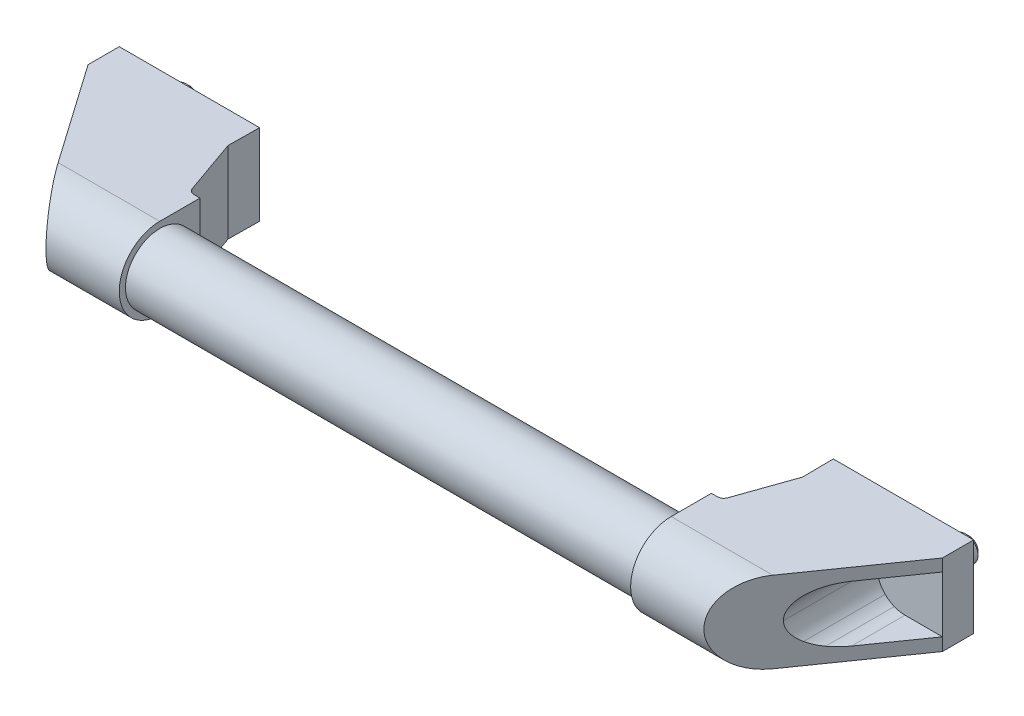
ISO-10303-21;
HEADER;
FILE_DESCRIPTION(('STEP AP214'),'2;1');
FILE_NAME('part.step','',(''),(''),'','','');
FILE_SCHEMA(('AUTOMOTIVE_DESIGN { 1 0 10303 214 1 1 1 1 }'));
ENDSEC;
DATA;
#1=APPLICATION_CONTEXT('core data for automotive mechanical design processes');
#2=APPLICATION_PROTOCOL_DEFINITION('international standard','automotive_design',2000,#1);
#3=PRODUCT_CONTEXT('',#1,'mechanical');
#4=PRODUCT('Part','Part','',(#3));
#5=PRODUCT_RELATED_PRODUCT_CATEGORY('part','',(#4));
#6=PRODUCT_DEFINITION_FORMATION('','',#4);
#7=PRODUCT_DEFINITION_CONTEXT('part definition',#1,'design');
#8=PRODUCT_DEFINITION('design','',#6,#7);
#9=PRODUCT_DEFINITION_SHAPE('','',#8);
#10=(LENGTH_UNIT() NAMED_UNIT(*) SI_UNIT(.MILLI.,.METRE.));
#11=(NAMED_UNIT(*) PLANE_ANGLE_UNIT() SI_UNIT($,.RADIAN.));
#12=(NAMED_UNIT(*) SI_UNIT($,.STERADIAN.) SOLID_ANGLE_UNIT());
#13=UNCERTAINTY_MEASURE_WITH_UNIT(LENGTH_MEASURE(1.E-05),#10,'distance_accuracy_value','');
#14=(GEOMETRIC_REPRESENTATION_CONTEXT(3) GLOBAL_UNCERTAINTY_ASSIGNED_CONTEXT((#13)) GLOBAL_UNIT_ASSIGNED_CONTEXT((#10,
#11,#12)) REPRESENTATION_CONTEXT('',''));
#15=CARTESIAN_POINT('',(0.,0.,0.));
#16=DIRECTION('',(0.,0.,1.));
#17=DIRECTION('',(1.,0.,0.));
#18=AXIS2_PLACEMENT_3D('',#15,#16,#17);
#19=CARTESIAN_POINT('',(262.,13.,-1.00180280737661E-13));
#20=DIRECTION('',(0.,0.,-1.));
#21=DIRECTION('',(-1.,0.,0.));
#22=AXIS2_PLACEMENT_3D('',#19,#20,#21);
#23=PLANE('',#22);
#24=DIRECTION('',(0.,-1.,0.));
#25=VECTOR('',#24,1.);
#26=CARTESIAN_POINT('',(237.,8.,0.));
#27=LINE('',#26,#25);
#28=CARTESIAN_POINT('',(237.,8.,0.));
#29=VERTEX_POINT('',#28);
#30=CARTESIAN_POINT('',(237.,-8.,0.));
#31=VERTEX_POINT('',#30);
#32=EDGE_CURVE('E497',#29,#31,#27,.T.);
#33=ORIENTED_EDGE('',*,*,#32,.F.);
#34=DIRECTION('',(-1.,0.,0.));
#35=VECTOR('',#34,1.);
#36=CARTESIAN_POINT('',(237.,8.,0.));
#37=LINE('',#36,#35);
#38=CARTESIAN_POINT('',(222.,8.,0.));
#39=VERTEX_POINT('',#38);
#40=EDGE_CURVE('E30',#29,#39,#37,.T.);
#41=ORIENTED_EDGE('',*,*,#40,.T.);
#42=DIRECTION('',(0.,1.,0.));
#43=VECTOR('',#42,1.);
#44=CARTESIAN_POINT('',(222.,-8.,0.));
#45=LINE('',#44,#43);
#46=CARTESIAN_POINT('',(222.,-8.,0.));
#47=VERTEX_POINT('',#46);
#48=EDGE_CURVE('E491',#47,#39,#45,.T.);
#49=ORIENTED_EDGE('',*,*,#48,.F.);
#50=DIRECTION('',(1.,0.,0.));
#51=VECTOR('',#50,1.);
#52=CARTESIAN_POINT('',(222.,-8.,0.));
#53=LINE('',#52,#51);
#54=EDGE_CURVE('E494',#47,#31,#53,.T.);
#55=ORIENTED_EDGE('',*,*,#54,.T.);
#56=EDGE_LOOP('',(#33,#41,#49,#55));
#57=FACE_BOUND('',#56,.T.);
#58=DIRECTION('',(0.,1.,0.));
#59=VECTOR('',#58,1.);
#60=CARTESIAN_POINT('',(217.,-13.,0.));
#61=LINE('',#60,#59);
#62=CARTESIAN_POINT('',(217.,-13.,0.));
#63=VERTEX_POINT('',#62);
#64=CARTESIAN_POINT('',(217.,13.,0.));
#65=VERTEX_POINT('',#64);
#66=EDGE_CURVE('E595',#63,#65,#61,.T.);
#67=ORIENTED_EDGE('',*,*,#66,.T.);
#68=DIRECTION('',(-1.,0.,0.));
#69=VECTOR('',#68,1.);
#70=CARTESIAN_POINT('',(262.,13.,-1.00180280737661E-13));
#71=LINE('',#70,#69);
#72=CARTESIAN_POINT('',(262.,13.,-1.00180280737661E-13));
#73=VERTEX_POINT('',#72);
#74=EDGE_CURVE('E626',#73,#65,#71,.T.);
#75=ORIENTED_EDGE('',*,*,#74,.F.);
#76=DIRECTION('',(0.,-1.,0.));
#77=VECTOR('',#76,1.);
#78=CARTESIAN_POINT('',(262.,13.,-1.00180280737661E-13));
#79=LINE('',#78,#77);
#80=CARTESIAN_POINT('',(262.,-13.,-1.00180280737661E-13));
#81=VERTEX_POINT('',#80);
#82=EDGE_CURVE('E621',#73,#81,#79,.T.);
#83=ORIENTED_EDGE('',*,*,#82,.T.);
#84=DIRECTION('',(-1.,0.,0.));
#85=VECTOR('',#84,1.);
#86=CARTESIAN_POINT('',(262.,-13.,-1.00180280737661E-13));
#87=LINE('',#86,#85);
#88=EDGE_CURVE('E629',#81,#63,#87,.T.);
#89=ORIENTED_EDGE('',*,*,#88,.T.);
#90=EDGE_LOOP('',(#67,#75,#83,#89));
#91=FACE_BOUND('',#90,.T.);
#92=CARTESIAN_POINT('',(250.,0.,0.));
#93=DIRECTION('',(0.,0.,1.));
#94=DIRECTION('',(1.,0.,0.));
#95=AXIS2_PLACEMENT_3D('',#92,#93,#94);
#96=CIRCLE('',#95,4.);
#97=CARTESIAN_POINT('',(254.,0.,0.));
#98=VERTEX_POINT('',#97);
#99=EDGE_CURVE('E481',#98,#98,#96,.T.);
#100=ORIENTED_EDGE('',*,*,#99,.T.);
#101=EDGE_LOOP('',(#100));
#102=FACE_BOUND('',#101,.T.);
#103=ADVANCED_FACE('F14',(#57,#91,#102),#23,.T.);
#104=CARTESIAN_POINT('',(262.,-13.,10.));
#105=DIRECTION('',(-0.819152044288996,0.,-0.573576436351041));
#106=DIRECTION('',(-0.573576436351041,0.,0.819152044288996));
#107=AXIS2_PLACEMENT_3D('',#104,#105,#106);
#108=PLANE('',#107);
#109=DIRECTION('',(0.573576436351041,0.,-0.819152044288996));
#110=VECTOR('',#109,1.);
#111=CARTESIAN_POINT('',(262.,-8.90119415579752,10.));
#112=LINE('',#111,#110);
#113=CARTESIAN_POINT('',(249.999992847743,-8.90119415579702,27.137786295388));
#114=VERTEX_POINT('',#113);
#115=CARTESIAN_POINT('',(262.,-8.90119415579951,10.));
#116=VERTEX_POINT('',#115);
#117=EDGE_CURVE('E9',#114,#116,#112,.T.);
#118=ORIENTED_EDGE('',*,*,#117,.F.);
#119=CARTESIAN_POINT('',(249.999999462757,0.0988421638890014,27.1377768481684));
#120=DIRECTION('',(-0.819152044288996,0.,-0.573576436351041));
#121=DIRECTION('',(-0.573576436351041,0.,0.819152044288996));
#122=AXIS2_PLACEMENT_3D('',#119,#120,#121);
#123=ELLIPSE('',#122,15.6910844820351,9.00003631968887);
#124=CARTESIAN_POINT('',(246.555841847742,-8.21611015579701,32.0565436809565));
#125=VERTEX_POINT('',#124);
#126=EDGE_CURVE('E23',#114,#125,#123,.T.);
#127=ORIENTED_EDGE('',*,*,#126,.T.);
#128=CARTESIAN_POINT('',(250.000013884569,0.0988360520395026,27.1377562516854));
#129=DIRECTION('',(-0.819152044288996,0.,-0.573576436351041));
#130=DIRECTION('',(-0.573576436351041,0.,0.819152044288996));
#131=AXIS2_PLACEMENT_3D('',#128,#129,#130);
#132=ELLIPSE('',#131,15.6910842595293,9.00003619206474);
#133=CARTESIAN_POINT('',(243.636031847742,-6.26515515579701,36.2264645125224));
#134=VERTEX_POINT('',#133);
#135=EDGE_CURVE('E651',#125,#134,#132,.T.);
#136=ORIENTED_EDGE('',*,*,#135,.T.);
#137=CARTESIAN_POINT('',(250.000032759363,0.0988180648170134,27.1377292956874));
#138=DIRECTION('',(-0.819152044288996,0.,-0.573576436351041));
#139=DIRECTION('',(-0.573576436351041,0.,0.819152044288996));
#140=AXIS2_PLACEMENT_3D('',#137,#138,#139);
#141=ELLIPSE('',#140,15.6910853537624,9.00003681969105);
#142=CARTESIAN_POINT('',(240.999995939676,0.0988089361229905,39.9911139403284));
#143=VERTEX_POINT('',#142);
#144=EDGE_CURVE('E648',#134,#143,#141,.T.);
#145=ORIENTED_EDGE('',*,*,#144,.T.);
#146=CARTESIAN_POINT('',(250.000030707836,0.098790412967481,27.1377322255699));
#147=DIRECTION('',(-0.819152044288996,0.,-0.573576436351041));
#148=DIRECTION('',(-0.573576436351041,0.,0.819152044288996));
#149=AXIS2_PLACEMENT_3D('',#146,#147,#148);
#150=ELLIPSE('',#149,15.6910817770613,9.00003476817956);
#151=CARTESIAN_POINT('',(243.636039,6.4627699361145,36.22645429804));
#152=VERTEX_POINT('',#151);
#153=EDGE_CURVE('E645',#143,#152,#150,.T.);
#154=ORIENTED_EDGE('',*,*,#153,.T.);
#155=CARTESIAN_POINT('',(250.000021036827,0.0987787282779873,27.1377460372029));
#156=DIRECTION('',(-0.819152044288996,0.,-0.573576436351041));
#157=DIRECTION('',(-0.573576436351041,0.,0.819152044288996));
#158=AXIS2_PLACEMENT_3D('',#155,#156,#157);
#159=ELLIPSE('',#158,15.6910842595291,9.00003619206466);
#160=CARTESIAN_POINT('',(246.555849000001,8.4137249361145,32.0565334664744));
#161=VERTEX_POINT('',#160);
#162=EDGE_CURVE('E642',#152,#161,#159,.T.);
#163=ORIENTED_EDGE('',*,*,#162,.T.);
#164=CARTESIAN_POINT('',(250.000006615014,0.098772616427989,27.1377666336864));
#165=DIRECTION('',(-0.819152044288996,0.,-0.573576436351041));
#166=DIRECTION('',(-0.573576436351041,0.,0.819152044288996));
#167=AXIS2_PLACEMENT_3D('',#164,#165,#166);
#168=ELLIPSE('',#167,15.691084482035,9.0000363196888);
#169=CARTESIAN_POINT('',(250.,9.09880893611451,27.1377760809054));
#170=VERTEX_POINT('',#169);
#171=EDGE_CURVE('E639',#161,#170,#168,.T.);
#172=ORIENTED_EDGE('',*,*,#171,.T.);
#173=DIRECTION('',(0.573576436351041,0.,-0.819152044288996));
#174=VECTOR('',#173,1.);
#175=CARTESIAN_POINT('',(262.,9.09880893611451,10.));
#176=LINE('',#175,#174);
#177=CARTESIAN_POINT('',(262.,9.09880893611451,10.));
#178=VERTEX_POINT('',#177);
#179=EDGE_CURVE('E636',#170,#178,#176,.T.);
#180=ORIENTED_EDGE('',*,*,#179,.T.);
#181=DIRECTION('',(0.,1.,0.));
#182=VECTOR('',#181,1.);
#183=CARTESIAN_POINT('',(262.,-13.,10.));
#184=LINE('',#183,#182);
#185=CARTESIAN_POINT('',(262.,13.,10.));
#186=VERTEX_POINT('',#185);
#187=EDGE_CURVE('E604',#178,#186,#184,.T.);
#188=ORIENTED_EDGE('',*,*,#187,.T.);
#189=DIRECTION('',(-0.573576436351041,0.,0.819152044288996));
#190=VECTOR('',#189,1.);
#191=CARTESIAN_POINT('',(262.,13.,10.));
#192=LINE('',#191,#190);
#193=CARTESIAN_POINT('',(239.59335877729,13.,42.));
#194=VERTEX_POINT('',#193);
#195=EDGE_CURVE('E598',#186,#194,#192,.T.);
#196=ORIENTED_EDGE('',*,*,#195,.T.);
#197=CARTESIAN_POINT('',(239.59335877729,0.,42.));
#198=DIRECTION('',(-0.819152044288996,0.,-0.573576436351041));
#199=DIRECTION('',(-0.573576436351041,0.,0.819152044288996));
#200=AXIS2_PLACEMENT_3D('',#197,#198,#199);
#201=ELLIPSE('',#200,15.8700696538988,13.);
#202=CARTESIAN_POINT('',(239.59335877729,-13.,42.));
#203=VERTEX_POINT('',#202);
#204=EDGE_CURVE('E608',#203,#194,#201,.T.);
#205=ORIENTED_EDGE('',*,*,#204,.F.);
#206=DIRECTION('',(-0.573576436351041,0.,0.819152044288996));
#207=VECTOR('',#206,1.);
#208=CARTESIAN_POINT('',(262.,-13.,10.));
#209=LINE('',#208,#207);
#210=CARTESIAN_POINT('',(262.,-13.,10.));
#211=VERTEX_POINT('',#210);
#212=EDGE_CURVE('E601',#211,#203,#209,.T.);
#213=ORIENTED_EDGE('',*,*,#212,.F.);
#214=EDGE_CURVE('E605',#211,#116,#184,.T.);
#215=ORIENTED_EDGE('',*,*,#214,.T.);
#216=EDGE_LOOP('',(#118,#127,#136,#145,#154,#163,#172,#180,#188,#196,#205,#213,#215));
#217=FACE_BOUND('',#216,.T.);
#218=ADVANCED_FACE('F657',(#217),#108,.F.);
#219=CARTESIAN_POINT('',(262.,13.,42.));
#220=DIRECTION('',(0.,1.,0.));
#221=DIRECTION('',(-1.,0.,0.));
#222=AXIS2_PLACEMENT_3D('',#219,#220,#221);
#223=PLANE('',#222);
#224=DIRECTION('',(-0.0104830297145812,0.,-0.999945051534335));
#225=VECTOR('',#224,1.);
#226=CARTESIAN_POINT('',(217.104830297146,13.,9.9994505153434));
#227=LINE('',#226,#225);
#228=CARTESIAN_POINT('',(217.104830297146,13.,9.9994505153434));
#229=VERTEX_POINT('',#228);
#230=EDGE_CURVE('E573',#229,#65,#227,.T.);
#231=ORIENTED_EDGE('',*,*,#230,.F.);
#232=DIRECTION('',(-0.332150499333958,0.,0.943226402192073));
#233=VECTOR('',#232,1.);
#234=CARTESIAN_POINT('',(217.104830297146,13.,9.9994505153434));
#235=LINE('',#234,#233);
#236=CARTESIAN_POINT('',(210.854102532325,13.,27.7499927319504));
#237=VERTEX_POINT('',#236);
#238=EDGE_CURVE('E570',#229,#237,#235,.T.);
#239=ORIENTED_EDGE('',*,*,#238,.T.);
#240=CARTESIAN_POINT('',(208.967649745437,13.,27.085691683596));
#241=DIRECTION('',(0.,1.,0.));
#242=DIRECTION('',(-1.,0.,0.));
#243=AXIS2_PLACEMENT_3D('',#240,#241,#242);
#244=CIRCLE('',#243,2.);
#245=CARTESIAN_POINT('',(208.988615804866,13.,29.0855817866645));
#246=VERTEX_POINT('',#245);
#247=EDGE_CURVE('E567',#246,#237,#244,.T.);
#248=ORIENTED_EDGE('',*,*,#247,.F.);
#249=DIRECTION('',(0.999945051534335,0.,-0.0104830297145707));
#250=VECTOR('',#249,1.);
#251=CARTESIAN_POINT('',(207.,13.,29.106429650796));
#252=LINE('',#251,#250);
#253=CARTESIAN_POINT('',(207.,13.,29.106429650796));
#254=VERTEX_POINT('',#253);
#255=EDGE_CURVE('E564',#254,#246,#252,.T.);
#256=ORIENTED_EDGE('',*,*,#255,.F.);
#257=DIRECTION('',(0.,0.,-1.));
#258=VECTOR('',#257,1.);
#259=CARTESIAN_POINT('',(207.,13.,42.));
#260=LINE('',#259,#258);
#261=CARTESIAN_POINT('',(207.,13.,42.));
#262=VERTEX_POINT('',#261);
#263=EDGE_CURVE('E610',#262,#254,#260,.T.);
#264=ORIENTED_EDGE('',*,*,#263,.F.);
#265=DIRECTION('',(-1.,0.,0.));
#266=VECTOR('',#265,1.);
#267=CARTESIAN_POINT('',(262.,13.,42.));
#268=LINE('',#267,#266);
#269=EDGE_CURVE('E634',#194,#262,#268,.T.);
#270=ORIENTED_EDGE('',*,*,#269,.F.);
#271=ORIENTED_EDGE('',*,*,#195,.F.);
#272=DIRECTION('',(0.,0.,-1.));
#273=VECTOR('',#272,1.);
#274=CARTESIAN_POINT('',(262.,13.,42.));
#275=LINE('',#274,#273);
#276=EDGE_CURVE('E619',#186,#73,#275,.T.);
#277=ORIENTED_EDGE('',*,*,#276,.T.);
#278=ORIENTED_EDGE('',*,*,#74,.T.);
#279=EDGE_LOOP('',(#231,#239,#248,#256,#264,#270,#271,#277,#278));
#280=FACE_BOUND('',#279,.T.);
#281=ADVANCED_FACE('F691',(#280),#223,.T.);
#282=CARTESIAN_POINT('',(262.,0.,42.));
#283=DIRECTION('',(-1.,0.,0.));
#284=DIRECTION('',(0.,-1.,0.));
#285=AXIS2_PLACEMENT_3D('',#282,#283,#284);
#286=CYLINDRICAL_SURFACE('',#285,13.);
#287=ORIENTED_EDGE('',*,*,#204,.T.);
#288=ORIENTED_EDGE('',*,*,#269,.T.);
#289=CARTESIAN_POINT('',(207.,0.,42.));
#290=DIRECTION('',(1.,0.,0.));
#291=DIRECTION('',(0.,1.,0.));
#292=AXIS2_PLACEMENT_3D('',#289,#290,#291);
#293=CIRCLE('',#292,13.);
#294=CARTESIAN_POINT('',(207.,-13.,42.));
#295=VERTEX_POINT('',#294);
#296=EDGE_CURVE('E616',#262,#295,#293,.T.);
#297=ORIENTED_EDGE('',*,*,#296,.T.);
#298=DIRECTION('',(-1.,0.,0.));
#299=VECTOR('',#298,1.);
#300=CARTESIAN_POINT('',(262.,-13.,42.));
#301=LINE('',#300,#299);
#302=EDGE_CURVE('E632',#203,#295,#301,.T.);
#303=ORIENTED_EDGE('',*,*,#302,.F.);
#304=EDGE_LOOP('',(#287,#288,#297,#303));
#305=FACE_BOUND('',#304,.T.);
#306=ADVANCED_FACE('F16',(#305),#286,.T.);
#307=CARTESIAN_POINT('',(262.,-13.,42.));
#308=DIRECTION('',(0.,1.,0.));
#309=DIRECTION('',(-1.,0.,0.));
#310=AXIS2_PLACEMENT_3D('',#307,#308,#309);
#311=PLANE('',#310);
#312=DIRECTION('',(-0.332150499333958,0.,0.943226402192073));
#313=VECTOR('',#312,1.);
#314=CARTESIAN_POINT('',(217.104830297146,-13.,9.9994505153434));
#315=LINE('',#314,#313);
#316=CARTESIAN_POINT('',(217.104830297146,-13.,9.9994505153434));
#317=VERTEX_POINT('',#316);
#318=CARTESIAN_POINT('',(210.854102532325,-13.,27.7499927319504));
#319=VERTEX_POINT('',#318);
#320=EDGE_CURVE('E581',#317,#319,#315,.T.);
#321=ORIENTED_EDGE('',*,*,#320,.F.);
#322=DIRECTION('',(-0.0104830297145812,0.,-0.999945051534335));
#323=VECTOR('',#322,1.);
#324=CARTESIAN_POINT('',(217.104830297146,-13.,9.9994505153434));
#325=LINE('',#324,#323);
#326=EDGE_CURVE('E584',#317,#63,#325,.T.);
#327=ORIENTED_EDGE('',*,*,#326,.T.);
#328=ORIENTED_EDGE('',*,*,#88,.F.);
#329=DIRECTION('',(0.,0.,-1.));
#330=VECTOR('',#329,1.);
#331=CARTESIAN_POINT('',(262.,-13.,42.));
#332=LINE('',#331,#330);
#333=EDGE_CURVE('E624',#211,#81,#332,.T.);
#334=ORIENTED_EDGE('',*,*,#333,.F.);
#335=ORIENTED_EDGE('',*,*,#212,.T.);
#336=ORIENTED_EDGE('',*,*,#302,.T.);
#337=DIRECTION('',(0.,0.,-1.));
#338=VECTOR('',#337,1.);
#339=CARTESIAN_POINT('',(207.,-13.,42.));
#340=LINE('',#339,#338);
#341=CARTESIAN_POINT('',(207.,-13.,29.106429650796));
#342=VERTEX_POINT('',#341);
#343=EDGE_CURVE('E613',#295,#342,#340,.T.);
#344=ORIENTED_EDGE('',*,*,#343,.T.);
#345=DIRECTION('',(0.999945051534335,0.,-0.0104830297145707));
#346=VECTOR('',#345,1.);
#347=CARTESIAN_POINT('',(207.,-13.,29.106429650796));
#348=LINE('',#347,#346);
#349=CARTESIAN_POINT('',(208.988615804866,-13.,29.0855817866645));
#350=VERTEX_POINT('',#349);
#351=EDGE_CURVE('E575',#342,#350,#348,.T.);
#352=ORIENTED_EDGE('',*,*,#351,.T.);
#353=CARTESIAN_POINT('',(208.967649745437,-13.,27.085691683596));
#354=DIRECTION('',(0.,1.,0.));
#355=DIRECTION('',(-1.,0.,0.));
#356=AXIS2_PLACEMENT_3D('',#353,#354,#355);
#357=CIRCLE('',#356,2.);
#358=EDGE_CURVE('E578',#350,#319,#357,.T.);
#359=ORIENTED_EDGE('',*,*,#358,.T.);
#360=EDGE_LOOP('',(#321,#327,#328,#334,#335,#336,#344,#352,#359));
#361=FACE_BOUND('',#360,.T.);
#362=ADVANCED_FACE('F701',(#361),#311,.F.);
#363=CARTESIAN_POINT('',(262.,0.,42.));
#364=DIRECTION('',(1.,0.,0.));
#365=DIRECTION('',(0.,1.,0.));
#366=AXIS2_PLACEMENT_3D('',#363,#364,#365);
#367=PLANE('',#366);
#368=ORIENTED_EDGE('',*,*,#214,.F.);
#369=ORIENTED_EDGE('',*,*,#333,.T.);
#370=ORIENTED_EDGE('',*,*,#82,.F.);
#371=ORIENTED_EDGE('',*,*,#276,.F.);
#372=ORIENTED_EDGE('',*,*,#187,.F.);
#373=DIRECTION('',(0.,1.,0.));
#374=VECTOR('',#373,1.);
#375=CARTESIAN_POINT('',(262.,-8.90119415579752,10.));
#376=LINE('',#375,#374);
#377=EDGE_CURVE('E541',#116,#178,#376,.T.);
#378=ORIENTED_EDGE('',*,*,#377,.F.);
#379=EDGE_LOOP('',(#368,#369,#370,#371,#372,#378));
#380=FACE_BOUND('',#379,.T.);
#381=ADVANCED_FACE('F686',(#380),#367,.T.);
#382=CARTESIAN_POINT('',(207.,0.,42.));
#383=DIRECTION('',(1.,0.,0.));
#384=DIRECTION('',(0.,1.,0.));
#385=AXIS2_PLACEMENT_3D('',#382,#383,#384);
#386=PLANE('',#385);
#387=CARTESIAN_POINT('',(207.,0.,42.));
#388=DIRECTION('',(1.,0.,0.));
#389=DIRECTION('',(0.,1.,0.));
#390=AXIS2_PLACEMENT_3D('',#387,#388,#389);
#391=CIRCLE('',#390,11.);
#392=CARTESIAN_POINT('',(207.,11.,42.));
#393=VERTEX_POINT('',#392);
#394=EDGE_CURVE('E18',#393,#393,#391,.T.);
#395=ORIENTED_EDGE('',*,*,#394,.T.);
#396=EDGE_LOOP('',(#395));
#397=FACE_BOUND('',#396,.T.);
#398=ORIENTED_EDGE('',*,*,#263,.T.);
#399=DIRECTION('',(0.,1.,0.));
#400=VECTOR('',#399,1.);
#401=CARTESIAN_POINT('',(207.,-13.,29.106429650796));
#402=LINE('',#401,#400);
#403=EDGE_CURVE('E587',#342,#254,#402,.T.);
#404=ORIENTED_EDGE('',*,*,#403,.F.);
#405=ORIENTED_EDGE('',*,*,#343,.F.);
#406=ORIENTED_EDGE('',*,*,#296,.F.);
#407=EDGE_LOOP('',(#398,#404,#405,#406));
#408=FACE_BOUND('',#407,.T.);
#409=ADVANCED_FACE('F717',(#397,#408),#386,.F.);
#410=CARTESIAN_POINT('',(217.104830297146,-13.,9.9994505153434));
#411=DIRECTION('',(0.999945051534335,0.,-0.0104830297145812));
#412=DIRECTION('',(-0.0104830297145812,0.,-0.999945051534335));
#413=AXIS2_PLACEMENT_3D('',#410,#411,#412);
#414=PLANE('',#413);
#415=DIRECTION('',(0.,1.,0.));
#416=VECTOR('',#415,1.);
#417=CARTESIAN_POINT('',(217.104830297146,-13.,9.9994505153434));
#418=LINE('',#417,#416);
#419=EDGE_CURVE('E593',#317,#229,#418,.T.);
#420=ORIENTED_EDGE('',*,*,#419,.T.);
#421=ORIENTED_EDGE('',*,*,#230,.T.);
#422=ORIENTED_EDGE('',*,*,#66,.F.);
#423=ORIENTED_EDGE('',*,*,#326,.F.);
#424=EDGE_LOOP('',(#420,#421,#422,#423));
#425=FACE_BOUND('',#424,.T.);
#426=ADVANCED_FACE('F698',(#425),#414,.F.);
#427=CARTESIAN_POINT('',(217.104830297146,-13.,9.9994505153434));
#428=DIRECTION('',(-0.943226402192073,0.,-0.332150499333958));
#429=DIRECTION('',(-0.332150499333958,0.,0.943226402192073));
#430=AXIS2_PLACEMENT_3D('',#427,#428,#429);
#431=PLANE('',#430);
#432=DIRECTION('',(0.,1.,0.));
#433=VECTOR('',#432,1.);
#434=CARTESIAN_POINT('',(210.854102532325,-13.,27.7499927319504));
#435=LINE('',#434,#433);
#436=EDGE_CURVE('E591',#319,#237,#435,.T.);
#437=ORIENTED_EDGE('',*,*,#436,.T.);
#438=ORIENTED_EDGE('',*,*,#238,.F.);
#439=ORIENTED_EDGE('',*,*,#419,.F.);
#440=ORIENTED_EDGE('',*,*,#320,.T.);
#441=EDGE_LOOP('',(#437,#438,#439,#440));
#442=FACE_BOUND('',#441,.T.);
#443=ADVANCED_FACE('F705',(#442),#431,.T.);
#444=CARTESIAN_POINT('',(208.967649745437,-13.,27.085691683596));
#445=DIRECTION('',(0.,1.,0.));
#446=DIRECTION('',(-1.,0.,0.));
#447=AXIS2_PLACEMENT_3D('',#444,#445,#446);
#448=CYLINDRICAL_SURFACE('',#447,2.);
#449=DIRECTION('',(0.,1.,0.));
#450=VECTOR('',#449,1.);
#451=CARTESIAN_POINT('',(208.988615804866,-13.,29.0855817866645));
#452=LINE('',#451,#450);
#453=EDGE_CURVE('E589',#350,#246,#452,.T.);
#454=ORIENTED_EDGE('',*,*,#453,.T.);
#455=ORIENTED_EDGE('',*,*,#247,.T.);
#456=ORIENTED_EDGE('',*,*,#436,.F.);
#457=ORIENTED_EDGE('',*,*,#358,.F.);
#458=EDGE_LOOP('',(#454,#455,#456,#457));
#459=FACE_BOUND('',#458,.T.);
#460=ADVANCED_FACE('F711',(#459),#448,.F.);
#461=CARTESIAN_POINT('',(207.,-13.,29.106429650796));
#462=DIRECTION('',(0.0104830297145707,0.,0.999945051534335));
#463=DIRECTION('',(0.999945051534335,0.,-0.0104830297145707));
#464=AXIS2_PLACEMENT_3D('',#461,#462,#463);
#465=PLANE('',#464);
#466=ORIENTED_EDGE('',*,*,#403,.T.);
#467=ORIENTED_EDGE('',*,*,#255,.T.);
#468=ORIENTED_EDGE('',*,*,#453,.F.);
#469=ORIENTED_EDGE('',*,*,#351,.F.);
#470=EDGE_LOOP('',(#466,#467,#468,#469));
#471=FACE_BOUND('',#470,.T.);
#472=ADVANCED_FACE('F713',(#471),#465,.F.);
#473=CARTESIAN_POINT('',(262.,-8.90119415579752,10.));
#474=DIRECTION('',(0.,1.,0.));
#475=DIRECTION('',(-1.,0.,0.));
#476=AXIS2_PLACEMENT_3D('',#473,#474,#475);
#477=PLANE('',#476);
#478=ORIENTED_EDGE('',*,*,#117,.T.);
#479=DIRECTION('',(-1.,0.,0.));
#480=VECTOR('',#479,1.);
#481=CARTESIAN_POINT('',(262.,-8.90119415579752,10.));
#482=LINE('',#481,#480);
#483=CARTESIAN_POINT('',(249.999992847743,-8.90119415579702,10.));
#484=VERTEX_POINT('',#483);
#485=EDGE_CURVE('E38',#116,#484,#482,.T.);
#486=ORIENTED_EDGE('',*,*,#485,.T.);
#487=DIRECTION('',(0.,0.,1.));
#488=VECTOR('',#487,1.);
#489=CARTESIAN_POINT('',(249.999992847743,-8.90119415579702,10.));
#490=LINE('',#489,#488);
#491=EDGE_CURVE('E561',#484,#114,#490,.T.);
#492=ORIENTED_EDGE('',*,*,#491,.T.);
#493=EDGE_LOOP('',(#478,#486,#492));
#494=FACE_BOUND('',#493,.T.);
#495=ADVANCED_FACE('F662',(#494),#477,.T.);
#496=CARTESIAN_POINT('',(249.999999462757,0.0988421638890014,10.));
#497=DIRECTION('',(0.,0.,1.));
#498=DIRECTION('',(1.,0.,0.));
#499=AXIS2_PLACEMENT_3D('',#496,#497,#498);
#500=CYLINDRICAL_SURFACE('',#499,9.00003631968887);
#501=ORIENTED_EDGE('',*,*,#491,.F.);
#502=CARTESIAN_POINT('',(249.999999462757,0.0988421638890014,10.));
#503=DIRECTION('',(0.,0.,1.));
#504=DIRECTION('',(1.,0.,0.));
#505=AXIS2_PLACEMENT_3D('',#502,#503,#504);
#506=CIRCLE('',#505,9.00003631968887);
#507=CARTESIAN_POINT('',(246.555841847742,-8.21611015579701,10.));
#508=VERTEX_POINT('',#507);
#509=EDGE_CURVE('E521',#508,#484,#506,.T.);
#510=ORIENTED_EDGE('',*,*,#509,.F.);
#511=DIRECTION('',(0.,0.,1.));
#512=VECTOR('',#511,1.);
#513=CARTESIAN_POINT('',(246.555841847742,-8.21611015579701,10.));
#514=LINE('',#513,#512);
#515=EDGE_CURVE('E558',#508,#125,#514,.T.);
#516=ORIENTED_EDGE('',*,*,#515,.T.);
#517=ORIENTED_EDGE('',*,*,#126,.F.);
#518=EDGE_LOOP('',(#501,#510,#516,#517));
#519=FACE_BOUND('',#518,.T.);
#520=ADVANCED_FACE('F659',(#519),#500,.F.);
#521=CARTESIAN_POINT('',(250.000013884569,0.0988360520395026,10.));
#522=DIRECTION('',(0.,0.,1.));
#523=DIRECTION('',(1.,0.,0.));
#524=AXIS2_PLACEMENT_3D('',#521,#522,#523);
#525=CYLINDRICAL_SURFACE('',#524,9.00003619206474);
#526=ORIENTED_EDGE('',*,*,#515,.F.);
#527=CARTESIAN_POINT('',(250.000013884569,0.0988360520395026,10.));
#528=DIRECTION('',(0.,0.,1.));
#529=DIRECTION('',(1.,0.,0.));
#530=AXIS2_PLACEMENT_3D('',#527,#528,#529);
#531=CIRCLE('',#530,9.00003619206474);
#532=CARTESIAN_POINT('',(243.636031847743,-6.26515515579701,10.));
#533=VERTEX_POINT('',#532);
#534=EDGE_CURVE('E523',#533,#508,#531,.T.);
#535=ORIENTED_EDGE('',*,*,#534,.F.);
#536=DIRECTION('',(0.,0.,1.));
#537=VECTOR('',#536,1.);
#538=CARTESIAN_POINT('',(243.636031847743,-6.26515515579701,10.));
#539=LINE('',#538,#537);
#540=EDGE_CURVE('E555',#533,#134,#539,.T.);
#541=ORIENTED_EDGE('',*,*,#540,.T.);
#542=ORIENTED_EDGE('',*,*,#135,.F.);
#543=EDGE_LOOP('',(#526,#535,#541,#542));
#544=FACE_BOUND('',#543,.T.);
#545=ADVANCED_FACE('F667',(#544),#525,.F.);
#546=CARTESIAN_POINT('',(250.000032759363,0.0988180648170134,10.));
#547=DIRECTION('',(0.,0.,1.));
#548=DIRECTION('',(1.,0.,0.));
#549=AXIS2_PLACEMENT_3D('',#546,#547,#548);
#550=CYLINDRICAL_SURFACE('',#549,9.00003681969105);
#551=ORIENTED_EDGE('',*,*,#540,.F.);
#552=CARTESIAN_POINT('',(250.000032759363,0.0988180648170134,10.));
#553=DIRECTION('',(0.,0.,1.));
#554=DIRECTION('',(1.,0.,0.));
#555=AXIS2_PLACEMENT_3D('',#552,#553,#554);
#556=CIRCLE('',#555,9.00003681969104);
#557=CARTESIAN_POINT('',(240.999995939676,0.0988089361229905,10.));
#558=VERTEX_POINT('',#557);
#559=EDGE_CURVE('E526',#558,#533,#556,.T.);
#560=ORIENTED_EDGE('',*,*,#559,.F.);
#561=DIRECTION('',(0.,0.,1.));
#562=VECTOR('',#561,1.);
#563=CARTESIAN_POINT('',(240.999995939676,0.0988089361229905,10.));
#564=LINE('',#563,#562);
#565=EDGE_CURVE('E552',#558,#143,#564,.T.);
#566=ORIENTED_EDGE('',*,*,#565,.T.);
#567=ORIENTED_EDGE('',*,*,#144,.F.);
#568=EDGE_LOOP('',(#551,#560,#566,#567));
#569=FACE_BOUND('',#568,.T.);
#570=ADVANCED_FACE('F669',(#569),#550,.F.);
#571=CARTESIAN_POINT('',(250.000030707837,0.098790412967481,10.));
#572=DIRECTION('',(0.,0.,1.));
#573=DIRECTION('',(1.,0.,0.));
#574=AXIS2_PLACEMENT_3D('',#571,#572,#573);
#575=CYLINDRICAL_SURFACE('',#574,9.00003476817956);
#576=ORIENTED_EDGE('',*,*,#565,.F.);
#577=CARTESIAN_POINT('',(250.000030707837,0.098790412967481,10.));
#578=DIRECTION('',(0.,0.,1.));
#579=DIRECTION('',(1.,0.,0.));
#580=AXIS2_PLACEMENT_3D('',#577,#578,#579);
#581=CIRCLE('',#580,9.00003476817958);
#582=CARTESIAN_POINT('',(243.636039,6.4627699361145,10.));
#583=VERTEX_POINT('',#582);
#584=EDGE_CURVE('E529',#583,#558,#581,.T.);
#585=ORIENTED_EDGE('',*,*,#584,.F.);
#586=DIRECTION('',(0.,0.,1.));
#587=VECTOR('',#586,1.);
#588=CARTESIAN_POINT('',(243.636039,6.4627699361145,10.));
#589=LINE('',#588,#587);
#590=EDGE_CURVE('E549',#583,#152,#589,.T.);
#591=ORIENTED_EDGE('',*,*,#590,.T.);
#592=ORIENTED_EDGE('',*,*,#153,.F.);
#593=EDGE_LOOP('',(#576,#585,#591,#592));
#594=FACE_BOUND('',#593,.T.);
#595=ADVANCED_FACE('F672',(#594),#575,.F.);
#596=CARTESIAN_POINT('',(250.000021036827,0.0987787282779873,10.));
#597=DIRECTION('',(0.,0.,1.));
#598=DIRECTION('',(1.,0.,0.));
#599=AXIS2_PLACEMENT_3D('',#596,#597,#598);
#600=CYLINDRICAL_SURFACE('',#599,9.00003619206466);
#601=ORIENTED_EDGE('',*,*,#590,.F.);
#602=CARTESIAN_POINT('',(250.000021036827,0.0987787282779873,10.));
#603=DIRECTION('',(0.,0.,1.));
#604=DIRECTION('',(1.,0.,0.));
#605=AXIS2_PLACEMENT_3D('',#602,#603,#604);
#606=CIRCLE('',#605,9.00003619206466);
#607=CARTESIAN_POINT('',(246.555849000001,8.4137249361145,10.));
#608=VERTEX_POINT('',#607);
#609=EDGE_CURVE('E532',#608,#583,#606,.T.);
#610=ORIENTED_EDGE('',*,*,#609,.F.);
#611=DIRECTION('',(0.,0.,1.));
#612=VECTOR('',#611,1.);
#613=CARTESIAN_POINT('',(246.555849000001,8.4137249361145,10.));
#614=LINE('',#613,#612);
#615=EDGE_CURVE('E546',#608,#161,#614,.T.);
#616=ORIENTED_EDGE('',*,*,#615,.T.);
#617=ORIENTED_EDGE('',*,*,#162,.F.);
#618=EDGE_LOOP('',(#601,#610,#616,#617));
#619=FACE_BOUND('',#618,.T.);
#620=ADVANCED_FACE('F676',(#619),#600,.F.);
#621=CARTESIAN_POINT('',(250.000006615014,0.098772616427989,10.));
#622=DIRECTION('',(0.,0.,1.));
#623=DIRECTION('',(1.,0.,0.));
#624=AXIS2_PLACEMENT_3D('',#621,#622,#623);
#625=CYLINDRICAL_SURFACE('',#624,9.0000363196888);
#626=ORIENTED_EDGE('',*,*,#615,.F.);
#627=CARTESIAN_POINT('',(250.000006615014,0.098772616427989,10.));
#628=DIRECTION('',(0.,0.,1.));
#629=DIRECTION('',(1.,0.,0.));
#630=AXIS2_PLACEMENT_3D('',#627,#628,#629);
#631=CIRCLE('',#630,9.0000363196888);
#632=CARTESIAN_POINT('',(250.,9.09880893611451,10.));
#633=VERTEX_POINT('',#632);
#634=EDGE_CURVE('E535',#633,#608,#631,.T.);
#635=ORIENTED_EDGE('',*,*,#634,.F.);
#636=DIRECTION('',(0.,0.,1.));
#637=VECTOR('',#636,1.);
#638=CARTESIAN_POINT('',(250.,9.09880893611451,10.));
#639=LINE('',#638,#637);
#640=EDGE_CURVE('E543',#633,#170,#639,.T.);
#641=ORIENTED_EDGE('',*,*,#640,.T.);
#642=ORIENTED_EDGE('',*,*,#171,.F.);
#643=EDGE_LOOP('',(#626,#635,#641,#642));
#644=FACE_BOUND('',#643,.T.);
#645=ADVANCED_FACE('F679',(#644),#625,.F.);
#646=CARTESIAN_POINT('',(262.,9.09880893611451,10.));
#647=DIRECTION('',(0.,1.,0.));
#648=DIRECTION('',(-1.,0.,0.));
#649=AXIS2_PLACEMENT_3D('',#646,#647,#648);
#650=PLANE('',#649);
#651=ORIENTED_EDGE('',*,*,#640,.F.);
#652=DIRECTION('',(-1.,0.,0.));
#653=VECTOR('',#652,1.);
#654=CARTESIAN_POINT('',(262.,9.09880893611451,10.));
#655=LINE('',#654,#653);
#656=EDGE_CURVE('E538',#178,#633,#655,.T.);
#657=ORIENTED_EDGE('',*,*,#656,.F.);
#658=ORIENTED_EDGE('',*,*,#179,.F.);
#659=EDGE_LOOP('',(#651,#657,#658));
#660=FACE_BOUND('',#659,.T.);
#661=ADVANCED_FACE('F764',(#660),#650,.F.);
#662=CARTESIAN_POINT('',(249.999999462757,0.0988421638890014,10.));
#663=DIRECTION('',(0.,0.,1.));
#664=DIRECTION('',(1.,0.,0.));
#665=AXIS2_PLACEMENT_3D('',#662,#663,#664);
#666=PLANE('',#665);
#667=ORIENTED_EDGE('',*,*,#485,.F.);
#668=ORIENTED_EDGE('',*,*,#377,.T.);
#669=ORIENTED_EDGE('',*,*,#656,.T.);
#670=ORIENTED_EDGE('',*,*,#634,.T.);
#671=ORIENTED_EDGE('',*,*,#609,.T.);
#672=ORIENTED_EDGE('',*,*,#584,.T.);
#673=ORIENTED_EDGE('',*,*,#559,.T.);
#674=ORIENTED_EDGE('',*,*,#534,.T.);
#675=ORIENTED_EDGE('',*,*,#509,.T.);
#676=EDGE_LOOP('',(#667,#668,#669,#670,#671,#672,#673,#674,#675));
#677=FACE_BOUND('',#676,.T.);
#678=ADVANCED_FACE('F664',(#677),#666,.T.);
#679=CARTESIAN_POINT('',(237.,8.,30.));
#680=DIRECTION('',(0.,-1.,0.));
#681=DIRECTION('',(1.,0.,0.));
#682=AXIS2_PLACEMENT_3D('',#679,#680,#681);
#683=PLANE('',#682);
#684=DIRECTION('',(0.,0.,-1.));
#685=VECTOR('',#684,1.);
#686=CARTESIAN_POINT('',(222.,8.,30.));
#687=LINE('',#686,#685);
#688=CARTESIAN_POINT('',(222.,8.,30.));
#689=VERTEX_POINT('',#688);
#690=EDGE_CURVE('E518',#689,#39,#687,.T.);
#691=ORIENTED_EDGE('',*,*,#690,.T.);
#692=ORIENTED_EDGE('',*,*,#40,.F.);
#693=DIRECTION('',(0.,0.,-1.));
#694=VECTOR('',#693,1.);
#695=CARTESIAN_POINT('',(237.,8.,30.));
#696=LINE('',#695,#694);
#697=CARTESIAN_POINT('',(237.,8.,30.));
#698=VERTEX_POINT('',#697);
#699=EDGE_CURVE('E512',#698,#29,#696,.T.);
#700=ORIENTED_EDGE('',*,*,#699,.F.);
#701=DIRECTION('',(-1.,0.,0.));
#702=VECTOR('',#701,1.);
#703=CARTESIAN_POINT('',(237.,8.,30.));
#704=LINE('',#703,#702);
#705=EDGE_CURVE('E500',#698,#689,#704,.T.);
#706=ORIENTED_EDGE('',*,*,#705,.T.);
#707=EDGE_LOOP('',(#691,#692,#700,#706));
#708=FACE_BOUND('',#707,.T.);
#709=ADVANCED_FACE('F771',(#708),#683,.T.);
#710=CARTESIAN_POINT('',(222.,-8.,30.));
#711=DIRECTION('',(-1.,0.,0.));
#712=DIRECTION('',(0.,-1.,0.));
#713=AXIS2_PLACEMENT_3D('',#710,#711,#712);
#714=PLANE('',#713);
#715=DIRECTION('',(0.,0.,-1.));
#716=VECTOR('',#715,1.);
#717=CARTESIAN_POINT('',(222.,-8.,30.));
#718=LINE('',#717,#716);
#719=CARTESIAN_POINT('',(222.,-8.,30.));
#720=VERTEX_POINT('',#719);
#721=EDGE_CURVE('E516',#720,#47,#718,.T.);
#722=ORIENTED_EDGE('',*,*,#721,.T.);
#723=ORIENTED_EDGE('',*,*,#48,.T.);
#724=ORIENTED_EDGE('',*,*,#690,.F.);
#725=DIRECTION('',(0.,1.,0.));
#726=VECTOR('',#725,1.);
#727=CARTESIAN_POINT('',(222.,-8.,30.));
#728=LINE('',#727,#726);
#729=EDGE_CURVE('E503',#720,#689,#728,.T.);
#730=ORIENTED_EDGE('',*,*,#729,.F.);
#731=EDGE_LOOP('',(#722,#723,#724,#730));
#732=FACE_BOUND('',#731,.T.);
#733=ADVANCED_FACE('F772',(#732),#714,.F.);
#734=CARTESIAN_POINT('',(222.,-8.,30.));
#735=DIRECTION('',(0.,1.,0.));
#736=DIRECTION('',(-1.,0.,0.));
#737=AXIS2_PLACEMENT_3D('',#734,#735,#736);
#738=PLANE('',#737);
#739=DIRECTION('',(0.,0.,-1.));
#740=VECTOR('',#739,1.);
#741=CARTESIAN_POINT('',(237.,-8.,30.));
#742=LINE('',#741,#740);
#743=CARTESIAN_POINT('',(237.,-8.,30.));
#744=VERTEX_POINT('',#743);
#745=EDGE_CURVE('E514',#744,#31,#742,.T.);
#746=ORIENTED_EDGE('',*,*,#745,.T.);
#747=ORIENTED_EDGE('',*,*,#54,.F.);
#748=ORIENTED_EDGE('',*,*,#721,.F.);
#749=DIRECTION('',(1.,0.,0.));
#750=VECTOR('',#749,1.);
#751=CARTESIAN_POINT('',(222.,-8.,30.));
#752=LINE('',#751,#750);
#753=EDGE_CURVE('E506',#720,#744,#752,.T.);
#754=ORIENTED_EDGE('',*,*,#753,.T.);
#755=EDGE_LOOP('',(#746,#747,#748,#754));
#756=FACE_BOUND('',#755,.T.);
#757=ADVANCED_FACE('F775',(#756),#738,.T.);
#758=CARTESIAN_POINT('',(237.,8.,30.));
#759=DIRECTION('',(1.,0.,0.));
#760=DIRECTION('',(0.,1.,0.));
#761=AXIS2_PLACEMENT_3D('',#758,#759,#760);
#762=PLANE('',#761);
#763=DIRECTION('',(0.,-1.,0.));
#764=VECTOR('',#763,1.);
#765=CARTESIAN_POINT('',(237.,8.,30.));
#766=LINE('',#765,#764);
#767=EDGE_CURVE('E509',#698,#744,#766,.T.);
#768=ORIENTED_EDGE('',*,*,#767,.F.);
#769=ORIENTED_EDGE('',*,*,#699,.T.);
#770=ORIENTED_EDGE('',*,*,#32,.T.);
#771=ORIENTED_EDGE('',*,*,#745,.F.);
#772=EDGE_LOOP('',(#768,#769,#770,#771));
#773=FACE_BOUND('',#772,.T.);
#774=ADVANCED_FACE('F779',(#773),#762,.F.);
#775=CARTESIAN_POINT('',(222.,8.,30.));
#776=DIRECTION('',(0.,0.,-1.));
#777=DIRECTION('',(-1.,0.,0.));
#778=AXIS2_PLACEMENT_3D('',#775,#776,#777);
#779=PLANE('',#778);
#780=ORIENTED_EDGE('',*,*,#705,.F.);
#781=ORIENTED_EDGE('',*,*,#767,.T.);
#782=ORIENTED_EDGE('',*,*,#753,.F.);
#783=ORIENTED_EDGE('',*,*,#729,.T.);
#784=EDGE_LOOP('',(#780,#781,#782,#783));
#785=FACE_BOUND('',#784,.T.);
#786=ADVANCED_FACE('F781',(#785),#779,.T.);
#787=CARTESIAN_POINT('',(250.,0.,-10.6));
#788=DIRECTION('',(0.,0.,1.));
#789=DIRECTION('',(1.,0.,0.));
#790=AXIS2_PLACEMENT_3D('',#787,#788,#789);
#791=PLANE('',#790);
#792=CARTESIAN_POINT('',(250.,0.,-10.6));
#793=DIRECTION('',(0.,0.,1.));
#794=DIRECTION('',(1.,0.,0.));
#795=AXIS2_PLACEMENT_3D('',#792,#793,#794);
#796=CIRCLE('',#795,2.8);
#797=CARTESIAN_POINT('',(252.8,0.,-10.6));
#798=VERTEX_POINT('',#797);
#799=EDGE_CURVE('E487',#798,#798,#796,.T.);
#800=ORIENTED_EDGE('',*,*,#799,.F.);
#801=EDGE_LOOP('',(#800));
#802=FACE_BOUND('',#801,.T.);
#803=ADVANCED_FACE('F785',(#802),#791,.F.);
#804=CARTESIAN_POINT('',(250.,0.,-10.6));
#805=DIRECTION('',(0.,0.,1.));
#806=DIRECTION('',(1.,0.,0.));
#807=AXIS2_PLACEMENT_3D('',#804,#805,#806);
#808=CONICAL_SURFACE('',#807,2.8,0.785398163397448);
#809=CARTESIAN_POINT('',(250.,0.,-9.4));
#810=DIRECTION('',(0.,0.,1.));
#811=DIRECTION('',(1.,0.,0.));
#812=AXIS2_PLACEMENT_3D('',#809,#810,#811);
#813=CIRCLE('',#812,4.);
#814=CARTESIAN_POINT('',(254.,0.,-9.4));
#815=VERTEX_POINT('',#814);
#816=EDGE_CURVE('E484',#815,#815,#813,.T.);
#817=ORIENTED_EDGE('',*,*,#816,.F.);
#818=EDGE_LOOP('',(#817));
#819=FACE_BOUND('',#818,.T.);
#820=ORIENTED_EDGE('',*,*,#799,.T.);
#821=EDGE_LOOP('',(#820));
#822=FACE_BOUND('',#821,.T.);
#823=ADVANCED_FACE('F793',(#819,#822),#808,.T.);
#824=CARTESIAN_POINT('',(250.,0.,27.1377760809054));
#825=DIRECTION('',(0.,0.,1.));
#826=DIRECTION('',(1.,0.,0.));
#827=AXIS2_PLACEMENT_3D('',#824,#825,#826);
#828=CYLINDRICAL_SURFACE('',#827,4.);
#829=ORIENTED_EDGE('',*,*,#816,.T.);
#830=EDGE_LOOP('',(#829));
#831=FACE_BOUND('',#830,.T.);
#832=ORIENTED_EDGE('',*,*,#99,.F.);
#833=EDGE_LOOP('',(#832));
#834=FACE_BOUND('',#833,.T.);
#835=ADVANCED_FACE('F797',(#831,#834),#828,.T.);
#836=CARTESIAN_POINT('',(246.555841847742,0.,42.));
#837=DIRECTION('',(1.,0.,0.));
#838=DIRECTION('',(0.,0.,-1.));
#839=AXIS2_PLACEMENT_3D('',#836,#837,#838);
#840=CYLINDRICAL_SURFACE('',#839,11.);
#841=ORIENTED_EDGE('',*,*,#394,.F.);
#842=EDGE_LOOP('',(#841));
#843=FACE_BOUND('',#842,.T.);
#844=CARTESIAN_POINT('',(43.,0.,42.));
#845=DIRECTION('',(1.,0.,0.));
#846=DIRECTION('',(0.,1.,0.));
#847=AXIS2_PLACEMENT_3D('',#844,#845,#846);
#848=CIRCLE('',#847,11.);
#849=CARTESIAN_POINT('',(43.,11.,42.));
#850=VERTEX_POINT('',#849);
#851=EDGE_CURVE('E477',#850,#850,#848,.T.);
#852=ORIENTED_EDGE('',*,*,#851,.T.);
#853=EDGE_LOOP('',(#852));
#854=FACE_BOUND('',#853,.T.);
#855=ADVANCED_FACE('F801',(#843,#854),#840,.T.);
#856=CARTESIAN_POINT('',(-12.,13.,0.));
#857=DIRECTION('',(0.,0.,-1.));
#858=DIRECTION('',(1.,0.,0.));
#859=AXIS2_PLACEMENT_3D('',#856,#857,#858);
#860=PLANE('',#859);
#861=DIRECTION('',(0.,-1.,0.));
#862=VECTOR('',#861,1.);
#863=CARTESIAN_POINT('',(13.,8.,0.));
#864=LINE('',#863,#862);
#865=CARTESIAN_POINT('',(13.,8.,0.));
#866=VERTEX_POINT('',#865);
#867=CARTESIAN_POINT('',(13.,-8.,0.));
#868=VERTEX_POINT('',#867);
#869=EDGE_CURVE('E319',#866,#868,#864,.T.);
#870=ORIENTED_EDGE('',*,*,#869,.T.);
#871=DIRECTION('',(-1.,0.,0.));
#872=VECTOR('',#871,1.);
#873=CARTESIAN_POINT('',(28.,-8.,0.));
#874=LINE('',#873,#872);
#875=CARTESIAN_POINT('',(28.,-8.,0.));
#876=VERTEX_POINT('',#875);
#877=EDGE_CURVE('E306',#876,#868,#874,.T.);
#878=ORIENTED_EDGE('',*,*,#877,.F.);
#879=DIRECTION('',(0.,1.,0.));
#880=VECTOR('',#879,1.);
#881=CARTESIAN_POINT('',(28.,-8.,0.));
#882=LINE('',#881,#880);
#883=CARTESIAN_POINT('',(28.,8.,0.));
#884=VERTEX_POINT('',#883);
#885=EDGE_CURVE('E288',#876,#884,#882,.T.);
#886=ORIENTED_EDGE('',*,*,#885,.T.);
#887=DIRECTION('',(1.,0.,0.));
#888=VECTOR('',#887,1.);
#889=CARTESIAN_POINT('',(13.,8.,0.));
#890=LINE('',#889,#888);
#891=EDGE_CURVE('E303',#866,#884,#890,.T.);
#892=ORIENTED_EDGE('',*,*,#891,.F.);
#893=EDGE_LOOP('',(#870,#878,#886,#892));
#894=FACE_BOUND('',#893,.T.);
#895=DIRECTION('',(0.,1.,0.));
#896=VECTOR('',#895,1.);
#897=CARTESIAN_POINT('',(33.,-13.,0.));
#898=LINE('',#897,#896);
#899=CARTESIAN_POINT('',(33.,-13.,0.));
#900=VERTEX_POINT('',#899);
#901=CARTESIAN_POINT('',(33.,13.,0.));
#902=VERTEX_POINT('',#901);
#903=EDGE_CURVE('E412',#900,#902,#898,.T.);
#904=ORIENTED_EDGE('',*,*,#903,.F.);
#905=DIRECTION('',(1.,0.,0.));
#906=VECTOR('',#905,1.);
#907=CARTESIAN_POINT('',(-12.,-13.,0.));
#908=LINE('',#907,#906);
#909=CARTESIAN_POINT('',(-12.,-13.,0.));
#910=VERTEX_POINT('',#909);
#911=EDGE_CURVE('E446',#910,#900,#908,.T.);
#912=ORIENTED_EDGE('',*,*,#911,.F.);
#913=DIRECTION('',(0.,-1.,0.));
#914=VECTOR('',#913,1.);
#915=CARTESIAN_POINT('',(-12.,13.,0.));
#916=LINE('',#915,#914);
#917=CARTESIAN_POINT('',(-12.,13.,0.));
#918=VERTEX_POINT('',#917);
#919=EDGE_CURVE('E438',#918,#910,#916,.T.);
#920=ORIENTED_EDGE('',*,*,#919,.F.);
#921=DIRECTION('',(1.,0.,0.));
#922=VECTOR('',#921,1.);
#923=CARTESIAN_POINT('',(-12.,13.,0.));
#924=LINE('',#923,#922);
#925=EDGE_CURVE('E443',#918,#902,#924,.T.);
#926=ORIENTED_EDGE('',*,*,#925,.T.);
#927=EDGE_LOOP('',(#904,#912,#920,#926));
#928=FACE_BOUND('',#927,.T.);
#929=CARTESIAN_POINT('',(0.,0.,0.));
#930=DIRECTION('',(0.,0.,-1.));
#931=DIRECTION('',(-1.,0.,0.));
#932=AXIS2_PLACEMENT_3D('',#929,#930,#931);
#933=CIRCLE('',#932,4.);
#934=CARTESIAN_POINT('',(-4.,0.,0.));
#935=VERTEX_POINT('',#934);
#936=EDGE_CURVE('E480',#935,#935,#933,.T.);
#937=ORIENTED_EDGE('',*,*,#936,.F.);
#938=EDGE_LOOP('',(#937));
#939=FACE_BOUND('',#938,.T.);
#940=ADVANCED_FACE('F301',(#894,#928,#939),#860,.T.);
#941=CARTESIAN_POINT('',(-12.,-13.,10.));
#942=DIRECTION('',(0.819152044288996,0.,-0.573576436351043));
#943=DIRECTION('',(0.573576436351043,0.,0.819152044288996));
#944=AXIS2_PLACEMENT_3D('',#941,#942,#943);
#945=PLANE('',#944);
#946=DIRECTION('',(-0.573576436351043,0.,-0.819152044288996));
#947=VECTOR('',#946,1.);
#948=CARTESIAN_POINT('',(-12.,-8.90119415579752,10.));
#949=LINE('',#948,#947);
#950=CARTESIAN_POINT('',(7.15225699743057E-06,-8.90119415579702,27.137786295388));
#951=VERTEX_POINT('',#950);
#952=CARTESIAN_POINT('',(-12.,-8.90119415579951,10.));
#953=VERTEX_POINT('',#952);
#954=EDGE_CURVE('E474',#951,#953,#949,.T.);
#955=ORIENTED_EDGE('',*,*,#954,.T.);
#956=DIRECTION('',(0.,1.,0.));
#957=VECTOR('',#956,1.);
#958=CARTESIAN_POINT('',(-12.,-13.,10.));
#959=LINE('',#958,#957);
#960=CARTESIAN_POINT('',(-12.,-13.,10.));
#961=VERTEX_POINT('',#960);
#962=EDGE_CURVE('E422',#961,#953,#959,.T.);
#963=ORIENTED_EDGE('',*,*,#962,.F.);
#964=DIRECTION('',(0.573576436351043,0.,0.819152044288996));
#965=VECTOR('',#964,1.);
#966=CARTESIAN_POINT('',(-12.,-13.,10.));
#967=LINE('',#966,#965);
#968=CARTESIAN_POINT('',(10.40664122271,-13.,42.));
#969=VERTEX_POINT('',#968);
#970=EDGE_CURVE('E418',#961,#969,#967,.T.);
#971=ORIENTED_EDGE('',*,*,#970,.T.);
#972=CARTESIAN_POINT('',(10.40664122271,0.,42.));
#973=DIRECTION('',(-0.819152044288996,0.,0.573576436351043));
#974=DIRECTION('',(0.573576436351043,0.,0.819152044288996));
#975=AXIS2_PLACEMENT_3D('',#972,#973,#974);
#976=ELLIPSE('',#975,15.8700696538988,13.);
#977=CARTESIAN_POINT('',(10.40664122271,13.,42.));
#978=VERTEX_POINT('',#977);
#979=EDGE_CURVE('E425',#969,#978,#976,.T.);
#980=ORIENTED_EDGE('',*,*,#979,.T.);
#981=DIRECTION('',(0.573576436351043,0.,0.819152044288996));
#982=VECTOR('',#981,1.);
#983=CARTESIAN_POINT('',(-12.,13.,10.));
#984=LINE('',#983,#982);
#985=CARTESIAN_POINT('',(-12.,13.,10.));
#986=VERTEX_POINT('',#985);
#987=EDGE_CURVE('E415',#986,#978,#984,.T.);
#988=ORIENTED_EDGE('',*,*,#987,.F.);
#989=CARTESIAN_POINT('',(-12.,9.09880893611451,10.));
#990=VERTEX_POINT('',#989);
#991=EDGE_CURVE('E421',#990,#986,#959,.T.);
#992=ORIENTED_EDGE('',*,*,#991,.F.);
#993=DIRECTION('',(-0.573576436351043,0.,-0.819152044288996));
#994=VECTOR('',#993,1.);
#995=CARTESIAN_POINT('',(-12.,9.09880893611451,10.));
#996=LINE('',#995,#994);
#997=CARTESIAN_POINT('',(0.,9.09880893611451,27.1377760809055));
#998=VERTEX_POINT('',#997);
#999=EDGE_CURVE('E453',#998,#990,#996,.T.);
#1000=ORIENTED_EDGE('',*,*,#999,.F.);
#1001=CARTESIAN_POINT('',(-6.61501451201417E-06,0.098772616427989,27.1377666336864));
#1002=DIRECTION('',(-0.819152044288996,0.,0.573576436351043));
#1003=DIRECTION('',(0.573576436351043,0.,0.819152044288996));
#1004=AXIS2_PLACEMENT_3D('',#1001,#1002,#1003);
#1005=ELLIPSE('',#1004,15.691084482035,9.0000363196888);
#1006=CARTESIAN_POINT('',(3.44415099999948,8.4137249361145,32.0565334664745));
#1007=VERTEX_POINT('',#1006);
#1008=EDGE_CURVE('E456',#1007,#998,#1005,.T.);
#1009=ORIENTED_EDGE('',*,*,#1008,.F.);
#1010=CARTESIAN_POINT('',(-2.10368275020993E-05,0.0987787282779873,27.1377460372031));
#1011=DIRECTION('',(-0.819152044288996,0.,0.573576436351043));
#1012=DIRECTION('',(0.573576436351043,0.,0.819152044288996));
#1013=AXIS2_PLACEMENT_3D('',#1010,#1011,#1012);
#1014=ELLIPSE('',#1013,15.6910842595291,9.00003619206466);
#1015=CARTESIAN_POINT('',(6.36396099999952,6.4627699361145,36.22645429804));
#1016=VERTEX_POINT('',#1015);
#1017=EDGE_CURVE('E459',#1016,#1007,#1014,.T.);
#1018=ORIENTED_EDGE('',*,*,#1017,.F.);
#1019=CARTESIAN_POINT('',(-3.07078369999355E-05,0.098790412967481,27.13773222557));
#1020=DIRECTION('',(-0.819152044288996,0.,0.573576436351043));
#1021=DIRECTION('',(0.573576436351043,0.,0.819152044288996));
#1022=AXIS2_PLACEMENT_3D('',#1019,#1020,#1021);
#1023=ELLIPSE('',#1022,15.6910817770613,9.00003476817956);
#1024=CARTESIAN_POINT('',(9.00000406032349,0.0988089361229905,39.9911139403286));
#1025=VERTEX_POINT('',#1024);
#1026=EDGE_CURVE('E462',#1025,#1016,#1023,.T.);
#1027=ORIENTED_EDGE('',*,*,#1026,.F.);
#1028=CARTESIAN_POINT('',(-3.27593624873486E-05,0.0988180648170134,27.1377292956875));
#1029=DIRECTION('',(-0.819152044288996,0.,0.573576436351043));
#1030=DIRECTION('',(0.573576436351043,0.,0.819152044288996));
#1031=AXIS2_PLACEMENT_3D('',#1028,#1029,#1030);
#1032=ELLIPSE('',#1031,15.6910853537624,9.00003681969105);
#1033=CARTESIAN_POINT('',(6.36396815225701,-6.26515515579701,36.2264645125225));
#1034=VERTEX_POINT('',#1033);
#1035=EDGE_CURVE('E465',#1034,#1025,#1032,.T.);
#1036=ORIENTED_EDGE('',*,*,#1035,.F.);
#1037=CARTESIAN_POINT('',(-1.38845694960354E-05,0.0988360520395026,27.1377562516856));
#1038=DIRECTION('',(-0.819152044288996,0.,0.573576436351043));
#1039=DIRECTION('',(0.573576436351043,0.,0.819152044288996));
#1040=AXIS2_PLACEMENT_3D('',#1037,#1038,#1039);
#1041=ELLIPSE('',#1040,15.6910842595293,9.00003619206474);
#1042=CARTESIAN_POINT('',(3.44415815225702,-8.21611015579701,32.0565436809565));
#1043=VERTEX_POINT('',#1042);
#1044=EDGE_CURVE('E468',#1043,#1034,#1041,.T.);
#1045=ORIENTED_EDGE('',*,*,#1044,.F.);
#1046=CARTESIAN_POINT('',(5.37243026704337E-07,0.0988421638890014,27.1377768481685));
#1047=DIRECTION('',(-0.819152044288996,0.,0.573576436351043));
#1048=DIRECTION('',(0.573576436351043,0.,0.819152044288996));
#1049=AXIS2_PLACEMENT_3D('',#1046,#1047,#1048);
#1050=ELLIPSE('',#1049,15.6910844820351,9.00003631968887);
#1051=EDGE_CURVE('E471',#951,#1043,#1050,.T.);
#1052=ORIENTED_EDGE('',*,*,#1051,.F.);
#1053=EDGE_LOOP('',(#955,#963,#971,#980,#988,#992,#1000,#1009,#1018,#1027,#1036,#1045,#1052));
#1054=FACE_BOUND('',#1053,.T.);
#1055=ADVANCED_FACE('F818',(#1054),#945,.F.);
#1056=CARTESIAN_POINT('',(-12.,13.,42.));
#1057=DIRECTION('',(0.,1.,0.));
#1058=DIRECTION('',(1.,0.,0.));
#1059=AXIS2_PLACEMENT_3D('',#1056,#1057,#1058);
#1060=PLANE('',#1059);
#1061=DIRECTION('',(0.0104830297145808,0.,-0.999945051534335));
#1062=VECTOR('',#1061,1.);
#1063=CARTESIAN_POINT('',(32.895169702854,13.,9.99945051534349));
#1064=LINE('',#1063,#1062);
#1065=CARTESIAN_POINT('',(32.895169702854,13.,9.99945051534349));
#1066=VERTEX_POINT('',#1065);
#1067=EDGE_CURVE('E390',#1066,#902,#1064,.T.);
#1068=ORIENTED_EDGE('',*,*,#1067,.T.);
#1069=ORIENTED_EDGE('',*,*,#925,.F.);
#1070=DIRECTION('',(0.,0.,-1.));
#1071=VECTOR('',#1070,1.);
#1072=CARTESIAN_POINT('',(-12.,13.,42.));
#1073=LINE('',#1072,#1071);
#1074=EDGE_CURVE('E436',#986,#918,#1073,.T.);
#1075=ORIENTED_EDGE('',*,*,#1074,.F.);
#1076=ORIENTED_EDGE('',*,*,#987,.T.);
#1077=DIRECTION('',(1.,0.,0.));
#1078=VECTOR('',#1077,1.);
#1079=CARTESIAN_POINT('',(-12.,13.,42.));
#1080=LINE('',#1079,#1078);
#1081=CARTESIAN_POINT('',(43.,13.,42.));
#1082=VERTEX_POINT('',#1081);
#1083=EDGE_CURVE('E451',#978,#1082,#1080,.T.);
#1084=ORIENTED_EDGE('',*,*,#1083,.T.);
#1085=DIRECTION('',(0.,0.,-1.));
#1086=VECTOR('',#1085,1.);
#1087=CARTESIAN_POINT('',(43.,13.,42.));
#1088=LINE('',#1087,#1086);
#1089=CARTESIAN_POINT('',(43.,13.,29.106429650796));
#1090=VERTEX_POINT('',#1089);
#1091=EDGE_CURVE('E427',#1082,#1090,#1088,.T.);
#1092=ORIENTED_EDGE('',*,*,#1091,.T.);
#1093=DIRECTION('',(-0.999945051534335,0.,-0.0104830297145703));
#1094=VECTOR('',#1093,1.);
#1095=CARTESIAN_POINT('',(43.,13.,29.106429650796));
#1096=LINE('',#1095,#1094);
#1097=CARTESIAN_POINT('',(41.0113841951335,13.,29.0855817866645));
#1098=VERTEX_POINT('',#1097);
#1099=EDGE_CURVE('E381',#1090,#1098,#1096,.T.);
#1100=ORIENTED_EDGE('',*,*,#1099,.T.);
#1101=CARTESIAN_POINT('',(41.0323502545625,13.,27.085691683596));
#1102=DIRECTION('',(0.,-1.,0.));
#1103=DIRECTION('',(1.,0.,0.));
#1104=AXIS2_PLACEMENT_3D('',#1101,#1102,#1103);
#1105=CIRCLE('',#1104,2.);
#1106=CARTESIAN_POINT('',(39.1458974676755,13.,27.7499927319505));
#1107=VERTEX_POINT('',#1106);
#1108=EDGE_CURVE('E384',#1098,#1107,#1105,.T.);
#1109=ORIENTED_EDGE('',*,*,#1108,.T.);
#1110=DIRECTION('',(0.332150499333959,0.,0.943226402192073));
#1111=VECTOR('',#1110,1.);
#1112=CARTESIAN_POINT('',(32.895169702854,13.,9.99945051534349));
#1113=LINE('',#1112,#1111);
#1114=EDGE_CURVE('E387',#1066,#1107,#1113,.T.);
#1115=ORIENTED_EDGE('',*,*,#1114,.F.);
#1116=EDGE_LOOP('',(#1068,#1069,#1075,#1076,#1084,#1092,#1100,#1109,#1115));
#1117=FACE_BOUND('',#1116,.T.);
#1118=ADVANCED_FACE('F810',(#1117),#1060,.T.);
#1119=CARTESIAN_POINT('',(-12.,0.,42.));
#1120=DIRECTION('',(1.,0.,0.));
#1121=DIRECTION('',(0.,-1.,0.));
#1122=AXIS2_PLACEMENT_3D('',#1119,#1120,#1121);
#1123=CYLINDRICAL_SURFACE('',#1122,13.);
#1124=ORIENTED_EDGE('',*,*,#979,.F.);
#1125=DIRECTION('',(1.,0.,0.));
#1126=VECTOR('',#1125,1.);
#1127=CARTESIAN_POINT('',(-12.,-13.,42.));
#1128=LINE('',#1127,#1126);
#1129=CARTESIAN_POINT('',(43.,-13.,42.));
#1130=VERTEX_POINT('',#1129);
#1131=EDGE_CURVE('E449',#969,#1130,#1128,.T.);
#1132=ORIENTED_EDGE('',*,*,#1131,.T.);
#1133=CARTESIAN_POINT('',(43.,0.,42.));
#1134=DIRECTION('',(1.,0.,0.));
#1135=DIRECTION('',(0.,1.,0.));
#1136=AXIS2_PLACEMENT_3D('',#1133,#1134,#1135);
#1137=CIRCLE('',#1136,13.);
#1138=EDGE_CURVE('E433',#1082,#1130,#1137,.T.);
#1139=ORIENTED_EDGE('',*,*,#1138,.F.);
#1140=ORIENTED_EDGE('',*,*,#1083,.F.);
#1141=EDGE_LOOP('',(#1124,#1132,#1139,#1140));
#1142=FACE_BOUND('',#1141,.T.);
#1143=ADVANCED_FACE('F806',(#1142),#1123,.T.);
#1144=CARTESIAN_POINT('',(-12.,-13.,42.));
#1145=DIRECTION('',(0.,1.,0.));
#1146=DIRECTION('',(1.,0.,0.));
#1147=AXIS2_PLACEMENT_3D('',#1144,#1145,#1146);
#1148=PLANE('',#1147);
#1149=DIRECTION('',(0.332150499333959,0.,0.943226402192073));
#1150=VECTOR('',#1149,1.);
#1151=CARTESIAN_POINT('',(32.895169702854,-13.,9.99945051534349));
#1152=LINE('',#1151,#1150);
#1153=CARTESIAN_POINT('',(32.895169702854,-13.,9.99945051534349));
#1154=VERTEX_POINT('',#1153);
#1155=CARTESIAN_POINT('',(39.1458974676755,-13.,27.7499927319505));
#1156=VERTEX_POINT('',#1155);
#1157=EDGE_CURVE('E398',#1154,#1156,#1152,.T.);
#1158=ORIENTED_EDGE('',*,*,#1157,.T.);
#1159=CARTESIAN_POINT('',(41.0323502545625,-13.,27.085691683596));
#1160=DIRECTION('',(0.,-1.,0.));
#1161=DIRECTION('',(1.,0.,0.));
#1162=AXIS2_PLACEMENT_3D('',#1159,#1160,#1161);
#1163=CIRCLE('',#1162,2.);
#1164=CARTESIAN_POINT('',(41.0113841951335,-13.,29.0855817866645));
#1165=VERTEX_POINT('',#1164);
#1166=EDGE_CURVE('E395',#1165,#1156,#1163,.T.);
#1167=ORIENTED_EDGE('',*,*,#1166,.F.);
#1168=DIRECTION('',(-0.999945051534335,0.,-0.0104830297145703));
#1169=VECTOR('',#1168,1.);
#1170=CARTESIAN_POINT('',(43.,-13.,29.106429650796));
#1171=LINE('',#1170,#1169);
#1172=CARTESIAN_POINT('',(43.,-13.,29.106429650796));
#1173=VERTEX_POINT('',#1172);
#1174=EDGE_CURVE('E392',#1173,#1165,#1171,.T.);
#1175=ORIENTED_EDGE('',*,*,#1174,.F.);
#1176=DIRECTION('',(0.,0.,-1.));
#1177=VECTOR('',#1176,1.);
#1178=CARTESIAN_POINT('',(43.,-13.,42.));
#1179=LINE('',#1178,#1177);
#1180=EDGE_CURVE('E430',#1130,#1173,#1179,.T.);
#1181=ORIENTED_EDGE('',*,*,#1180,.F.);
#1182=ORIENTED_EDGE('',*,*,#1131,.F.);
#1183=ORIENTED_EDGE('',*,*,#970,.F.);
#1184=DIRECTION('',(0.,0.,-1.));
#1185=VECTOR('',#1184,1.);
#1186=CARTESIAN_POINT('',(-12.,-13.,42.));
#1187=LINE('',#1186,#1185);
#1188=EDGE_CURVE('E441',#961,#910,#1187,.T.);
#1189=ORIENTED_EDGE('',*,*,#1188,.T.);
#1190=ORIENTED_EDGE('',*,*,#911,.T.);
#1191=DIRECTION('',(0.0104830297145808,0.,-0.999945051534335));
#1192=VECTOR('',#1191,1.);
#1193=CARTESIAN_POINT('',(32.895169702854,-13.,9.99945051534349));
#1194=LINE('',#1193,#1192);
#1195=EDGE_CURVE('E401',#1154,#900,#1194,.T.);
#1196=ORIENTED_EDGE('',*,*,#1195,.F.);
#1197=EDGE_LOOP('',(#1158,#1167,#1175,#1181,#1182,#1183,#1189,#1190,#1196));
#1198=FACE_BOUND('',#1197,.T.);
#1199=ADVANCED_FACE('F809',(#1198),#1148,.F.);
#1200=CARTESIAN_POINT('',(-12.,0.,42.));
#1201=DIRECTION('',(-1.,0.,0.));
#1202=DIRECTION('',(0.,1.,0.));
#1203=AXIS2_PLACEMENT_3D('',#1200,#1201,#1202);
#1204=PLANE('',#1203);
#1205=ORIENTED_EDGE('',*,*,#962,.T.);
#1206=DIRECTION('',(0.,1.,0.));
#1207=VECTOR('',#1206,1.);
#1208=CARTESIAN_POINT('',(-12.,-8.90119415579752,10.));
#1209=LINE('',#1208,#1207);
#1210=EDGE_CURVE('E357',#953,#990,#1209,.T.);
#1211=ORIENTED_EDGE('',*,*,#1210,.T.);
#1212=ORIENTED_EDGE('',*,*,#991,.T.);
#1213=ORIENTED_EDGE('',*,*,#1074,.T.);
#1214=ORIENTED_EDGE('',*,*,#919,.T.);
#1215=ORIENTED_EDGE('',*,*,#1188,.F.);
#1216=EDGE_LOOP('',(#1205,#1211,#1212,#1213,#1214,#1215));
#1217=FACE_BOUND('',#1216,.T.);
#1218=ADVANCED_FACE('F814',(#1217),#1204,.T.);
#1219=CARTESIAN_POINT('',(43.,0.,42.));
#1220=DIRECTION('',(-1.,0.,0.));
#1221=DIRECTION('',(0.,1.,0.));
#1222=AXIS2_PLACEMENT_3D('',#1219,#1220,#1221);
#1223=PLANE('',#1222);
#1224=ORIENTED_EDGE('',*,*,#851,.F.);
#1225=EDGE_LOOP('',(#1224));
#1226=FACE_BOUND('',#1225,.T.);
#1227=ORIENTED_EDGE('',*,*,#1091,.F.);
#1228=ORIENTED_EDGE('',*,*,#1138,.T.);
#1229=ORIENTED_EDGE('',*,*,#1180,.T.);
#1230=DIRECTION('',(0.,1.,0.));
#1231=VECTOR('',#1230,1.);
#1232=CARTESIAN_POINT('',(43.,-13.,29.106429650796));
#1233=LINE('',#1232,#1231);
#1234=EDGE_CURVE('E404',#1173,#1090,#1233,.T.);
#1235=ORIENTED_EDGE('',*,*,#1234,.T.);
#1236=EDGE_LOOP('',(#1227,#1228,#1229,#1235));
#1237=FACE_BOUND('',#1236,.T.);
#1238=ADVANCED_FACE('F824',(#1226,#1237),#1223,.F.);
#1239=CARTESIAN_POINT('',(32.895169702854,-13.,9.99945051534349));
#1240=DIRECTION('',(-0.999945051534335,0.,-0.0104830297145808));
#1241=DIRECTION('',(0.0104830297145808,0.,-0.999945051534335));
#1242=AXIS2_PLACEMENT_3D('',#1239,#1240,#1241);
#1243=PLANE('',#1242);
#1244=DIRECTION('',(0.,1.,0.));
#1245=VECTOR('',#1244,1.);
#1246=CARTESIAN_POINT('',(32.895169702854,-13.,9.99945051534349));
#1247=LINE('',#1246,#1245);
#1248=EDGE_CURVE('E410',#1154,#1066,#1247,.T.);
#1249=ORIENTED_EDGE('',*,*,#1248,.F.);
#1250=ORIENTED_EDGE('',*,*,#1195,.T.);
#1251=ORIENTED_EDGE('',*,*,#903,.T.);
#1252=ORIENTED_EDGE('',*,*,#1067,.F.);
#1253=EDGE_LOOP('',(#1249,#1250,#1251,#1252));
#1254=FACE_BOUND('',#1253,.T.);
#1255=ADVANCED_FACE('F828',(#1254),#1243,.F.);
#1256=CARTESIAN_POINT('',(32.895169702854,-13.,9.99945051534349));
#1257=DIRECTION('',(0.943226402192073,0.,-0.332150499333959));
#1258=DIRECTION('',(0.332150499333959,0.,0.943226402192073));
#1259=AXIS2_PLACEMENT_3D('',#1256,#1257,#1258);
#1260=PLANE('',#1259);
#1261=DIRECTION('',(0.,1.,0.));
#1262=VECTOR('',#1261,1.);
#1263=CARTESIAN_POINT('',(39.1458974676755,-13.,27.7499927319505));
#1264=LINE('',#1263,#1262);
#1265=EDGE_CURVE('E408',#1156,#1107,#1264,.T.);
#1266=ORIENTED_EDGE('',*,*,#1265,.F.);
#1267=ORIENTED_EDGE('',*,*,#1157,.F.);
#1268=ORIENTED_EDGE('',*,*,#1248,.T.);
#1269=ORIENTED_EDGE('',*,*,#1114,.T.);
#1270=EDGE_LOOP('',(#1266,#1267,#1268,#1269));
#1271=FACE_BOUND('',#1270,.T.);
#1272=ADVANCED_FACE('F835',(#1271),#1260,.T.);
#1273=CARTESIAN_POINT('',(41.0323502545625,-13.,27.085691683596));
#1274=DIRECTION('',(0.,1.,0.));
#1275=DIRECTION('',(1.,0.,0.));
#1276=AXIS2_PLACEMENT_3D('',#1273,#1274,#1275);
#1277=CYLINDRICAL_SURFACE('',#1276,2.);
#1278=DIRECTION('',(0.,1.,0.));
#1279=VECTOR('',#1278,1.);
#1280=CARTESIAN_POINT('',(41.0113841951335,-13.,29.0855817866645));
#1281=LINE('',#1280,#1279);
#1282=EDGE_CURVE('E406',#1165,#1098,#1281,.T.);
#1283=ORIENTED_EDGE('',*,*,#1282,.F.);
#1284=ORIENTED_EDGE('',*,*,#1166,.T.);
#1285=ORIENTED_EDGE('',*,*,#1265,.T.);
#1286=ORIENTED_EDGE('',*,*,#1108,.F.);
#1287=EDGE_LOOP('',(#1283,#1284,#1285,#1286));
#1288=FACE_BOUND('',#1287,.T.);
#1289=ADVANCED_FACE('F839',(#1288),#1277,.F.);
#1290=CARTESIAN_POINT('',(43.,-13.,29.106429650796));
#1291=DIRECTION('',(-0.0104830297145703,0.,0.999945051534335));
#1292=DIRECTION('',(-0.999945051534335,0.,-0.0104830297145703));
#1293=AXIS2_PLACEMENT_3D('',#1290,#1291,#1292);
#1294=PLANE('',#1293);
#1295=ORIENTED_EDGE('',*,*,#1234,.F.);
#1296=ORIENTED_EDGE('',*,*,#1174,.T.);
#1297=ORIENTED_EDGE('',*,*,#1282,.T.);
#1298=ORIENTED_EDGE('',*,*,#1099,.F.);
#1299=EDGE_LOOP('',(#1295,#1296,#1297,#1298));
#1300=FACE_BOUND('',#1299,.T.);
#1301=ADVANCED_FACE('F843',(#1300),#1294,.F.);
#1302=CARTESIAN_POINT('',(-12.,-8.90119415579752,10.));
#1303=DIRECTION('',(0.,1.,0.));
#1304=DIRECTION('',(1.,0.,0.));
#1305=AXIS2_PLACEMENT_3D('',#1302,#1303,#1304);
#1306=PLANE('',#1305);
#1307=ORIENTED_EDGE('',*,*,#954,.F.);
#1308=DIRECTION('',(0.,0.,1.));
#1309=VECTOR('',#1308,1.);
#1310=CARTESIAN_POINT('',(7.1522570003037E-06,-8.90119415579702,10.));
#1311=LINE('',#1310,#1309);
#1312=CARTESIAN_POINT('',(7.1522570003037E-06,-8.90119415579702,10.));
#1313=VERTEX_POINT('',#1312);
#1314=EDGE_CURVE('E378',#1313,#951,#1311,.T.);
#1315=ORIENTED_EDGE('',*,*,#1314,.F.);
#1316=DIRECTION('',(1.,0.,0.));
#1317=VECTOR('',#1316,1.);
#1318=CARTESIAN_POINT('',(-12.,-8.90119415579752,10.));
#1319=LINE('',#1318,#1317);
#1320=EDGE_CURVE('E295',#953,#1313,#1319,.T.);
#1321=ORIENTED_EDGE('',*,*,#1320,.F.);
#1322=EDGE_LOOP('',(#1307,#1315,#1321));
#1323=FACE_BOUND('',#1322,.T.);
#1324=ADVANCED_FACE('F847',(#1323),#1306,.T.);
#1325=CARTESIAN_POINT('',(5.37243021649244E-07,0.0988421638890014,10.));
#1326=DIRECTION('',(0.,0.,1.));
#1327=DIRECTION('',(-1.,0.,0.));
#1328=AXIS2_PLACEMENT_3D('',#1325,#1326,#1327);
#1329=CYLINDRICAL_SURFACE('',#1328,9.00003631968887);
#1330=ORIENTED_EDGE('',*,*,#1314,.T.);
#1331=ORIENTED_EDGE('',*,*,#1051,.T.);
#1332=DIRECTION('',(0.,0.,1.));
#1333=VECTOR('',#1332,1.);
#1334=CARTESIAN_POINT('',(3.44415815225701,-8.21611015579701,10.));
#1335=LINE('',#1334,#1333);
#1336=CARTESIAN_POINT('',(3.44415815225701,-8.21611015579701,10.));
#1337=VERTEX_POINT('',#1336);
#1338=EDGE_CURVE('E375',#1337,#1043,#1335,.T.);
#1339=ORIENTED_EDGE('',*,*,#1338,.F.);
#1340=CARTESIAN_POINT('',(5.37243021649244E-07,0.0988421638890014,10.));
#1341=DIRECTION('',(0.,0.,-1.));
#1342=DIRECTION('',(-1.,0.,0.));
#1343=AXIS2_PLACEMENT_3D('',#1340,#1341,#1342);
#1344=CIRCLE('',#1343,9.00003631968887);
#1345=EDGE_CURVE('E336',#1337,#1313,#1344,.T.);
#1346=ORIENTED_EDGE('',*,*,#1345,.T.);
#1347=EDGE_LOOP('',(#1330,#1331,#1339,#1346));
#1348=FACE_BOUND('',#1347,.T.);
#1349=ADVANCED_FACE('F849',(#1348),#1329,.F.);
#1350=CARTESIAN_POINT('',(-1.38845694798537E-05,0.0988360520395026,10.));
#1351=DIRECTION('',(0.,0.,1.));
#1352=DIRECTION('',(-1.,0.,0.));
#1353=AXIS2_PLACEMENT_3D('',#1350,#1351,#1352);
#1354=CYLINDRICAL_SURFACE('',#1353,9.00003619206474);
#1355=ORIENTED_EDGE('',*,*,#1338,.T.);
#1356=ORIENTED_EDGE('',*,*,#1044,.T.);
#1357=DIRECTION('',(0.,0.,1.));
#1358=VECTOR('',#1357,1.);
#1359=CARTESIAN_POINT('',(6.363968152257,-6.26515515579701,10.));
#1360=LINE('',#1359,#1358);
#1361=CARTESIAN_POINT('',(6.363968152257,-6.26515515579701,10.));
#1362=VERTEX_POINT('',#1361);
#1363=EDGE_CURVE('E372',#1362,#1034,#1360,.T.);
#1364=ORIENTED_EDGE('',*,*,#1363,.F.);
#1365=CARTESIAN_POINT('',(-1.38845694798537E-05,0.0988360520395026,10.));
#1366=DIRECTION('',(0.,0.,-1.));
#1367=DIRECTION('',(-1.,0.,0.));
#1368=AXIS2_PLACEMENT_3D('',#1365,#1366,#1367);
#1369=CIRCLE('',#1368,9.00003619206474);
#1370=EDGE_CURVE('E339',#1362,#1337,#1369,.T.);
#1371=ORIENTED_EDGE('',*,*,#1370,.T.);
#1372=EDGE_LOOP('',(#1355,#1356,#1364,#1371));
#1373=FACE_BOUND('',#1372,.T.);
#1374=ADVANCED_FACE('F852',(#1373),#1354,.F.);
#1375=CARTESIAN_POINT('',(-3.27593624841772E-05,0.0988180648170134,10.));
#1376=DIRECTION('',(0.,0.,1.));
#1377=DIRECTION('',(-1.,0.,0.));
#1378=AXIS2_PLACEMENT_3D('',#1375,#1376,#1377);
#1379=CYLINDRICAL_SURFACE('',#1378,9.00003681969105);
#1380=ORIENTED_EDGE('',*,*,#1363,.T.);
#1381=ORIENTED_EDGE('',*,*,#1035,.T.);
#1382=DIRECTION('',(0.,0.,1.));
#1383=VECTOR('',#1382,1.);
#1384=CARTESIAN_POINT('',(9.00000406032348,0.0988089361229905,10.));
#1385=LINE('',#1384,#1383);
#1386=CARTESIAN_POINT('',(9.00000406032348,0.0988089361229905,10.));
#1387=VERTEX_POINT('',#1386);
#1388=EDGE_CURVE('E369',#1387,#1025,#1385,.T.);
#1389=ORIENTED_EDGE('',*,*,#1388,.F.);
#1390=CARTESIAN_POINT('',(-3.27593624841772E-05,0.0988180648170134,10.));
#1391=DIRECTION('',(0.,0.,-1.));
#1392=DIRECTION('',(-1.,0.,0.));
#1393=AXIS2_PLACEMENT_3D('',#1390,#1391,#1392);
#1394=CIRCLE('',#1393,9.00003681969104);
#1395=EDGE_CURVE('E342',#1387,#1362,#1394,.T.);
#1396=ORIENTED_EDGE('',*,*,#1395,.T.);
#1397=EDGE_LOOP('',(#1380,#1381,#1389,#1396));
#1398=FACE_BOUND('',#1397,.T.);
#1399=ADVANCED_FACE('F856',(#1398),#1379,.F.);
#1400=CARTESIAN_POINT('',(-3.07078369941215E-05,0.098790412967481,10.));
#1401=DIRECTION('',(0.,0.,1.));
#1402=DIRECTION('',(-1.,0.,0.));
#1403=AXIS2_PLACEMENT_3D('',#1400,#1401,#1402);
#1404=CYLINDRICAL_SURFACE('',#1403,9.00003476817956);
#1405=ORIENTED_EDGE('',*,*,#1388,.T.);
#1406=ORIENTED_EDGE('',*,*,#1026,.T.);
#1407=DIRECTION('',(0.,0.,1.));
#1408=VECTOR('',#1407,1.);
#1409=CARTESIAN_POINT('',(6.36396099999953,6.4627699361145,10.));
#1410=LINE('',#1409,#1408);
#1411=CARTESIAN_POINT('',(6.36396099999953,6.4627699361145,10.));
#1412=VERTEX_POINT('',#1411);
#1413=EDGE_CURVE('E366',#1412,#1016,#1410,.T.);
#1414=ORIENTED_EDGE('',*,*,#1413,.F.);
#1415=CARTESIAN_POINT('',(-3.07078369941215E-05,0.098790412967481,10.));
#1416=DIRECTION('',(0.,0.,-1.));
#1417=DIRECTION('',(-1.,0.,0.));
#1418=AXIS2_PLACEMENT_3D('',#1415,#1416,#1417);
#1419=CIRCLE('',#1418,9.00003476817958);
#1420=EDGE_CURVE('E345',#1412,#1387,#1419,.T.);
#1421=ORIENTED_EDGE('',*,*,#1420,.T.);
#1422=EDGE_LOOP('',(#1405,#1406,#1414,#1421));
#1423=FACE_BOUND('',#1422,.T.);
#1424=ADVANCED_FACE('F860',(#1423),#1404,.F.);
#1425=CARTESIAN_POINT('',(-2.10368275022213E-05,0.0987787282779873,10.));
#1426=DIRECTION('',(0.,0.,1.));
#1427=DIRECTION('',(-1.,0.,0.));
#1428=AXIS2_PLACEMENT_3D('',#1425,#1426,#1427);
#1429=CYLINDRICAL_SURFACE('',#1428,9.00003619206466);
#1430=ORIENTED_EDGE('',*,*,#1413,.T.);
#1431=ORIENTED_EDGE('',*,*,#1017,.T.);
#1432=DIRECTION('',(0.,0.,1.));
#1433=VECTOR('',#1432,1.);
#1434=CARTESIAN_POINT('',(3.44415099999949,8.4137249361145,10.));
#1435=LINE('',#1434,#1433);
#1436=CARTESIAN_POINT('',(3.44415099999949,8.4137249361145,10.));
#1437=VERTEX_POINT('',#1436);
#1438=EDGE_CURVE('E363',#1437,#1007,#1435,.T.);
#1439=ORIENTED_EDGE('',*,*,#1438,.F.);
#1440=CARTESIAN_POINT('',(-2.10368275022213E-05,0.0987787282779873,10.));
#1441=DIRECTION('',(0.,0.,-1.));
#1442=DIRECTION('',(-1.,0.,0.));
#1443=AXIS2_PLACEMENT_3D('',#1440,#1441,#1442);
#1444=CIRCLE('',#1443,9.00003619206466);
#1445=EDGE_CURVE('E348',#1437,#1412,#1444,.T.);
#1446=ORIENTED_EDGE('',*,*,#1445,.T.);
#1447=EDGE_LOOP('',(#1430,#1431,#1439,#1446));
#1448=FACE_BOUND('',#1447,.T.);
#1449=ADVANCED_FACE('F864',(#1448),#1429,.F.);
#1450=CARTESIAN_POINT('',(-6.61501450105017E-06,0.098772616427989,10.));
#1451=DIRECTION('',(0.,0.,1.));
#1452=DIRECTION('',(-1.,0.,0.));
#1453=AXIS2_PLACEMENT_3D('',#1450,#1451,#1452);
#1454=CYLINDRICAL_SURFACE('',#1453,9.0000363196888);
#1455=ORIENTED_EDGE('',*,*,#1438,.T.);
#1456=ORIENTED_EDGE('',*,*,#1008,.T.);
#1457=DIRECTION('',(0.,0.,1.));
#1458=VECTOR('',#1457,1.);
#1459=CARTESIAN_POINT('',(0.,9.09880893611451,10.));
#1460=LINE('',#1459,#1458);
#1461=CARTESIAN_POINT('',(0.,9.09880893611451,10.));
#1462=VERTEX_POINT('',#1461);
#1463=EDGE_CURVE('E360',#1462,#998,#1460,.T.);
#1464=ORIENTED_EDGE('',*,*,#1463,.F.);
#1465=CARTESIAN_POINT('',(-6.61501450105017E-06,0.098772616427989,10.));
#1466=DIRECTION('',(0.,0.,-1.));
#1467=DIRECTION('',(-1.,0.,0.));
#1468=AXIS2_PLACEMENT_3D('',#1465,#1466,#1467);
#1469=CIRCLE('',#1468,9.0000363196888);
#1470=EDGE_CURVE('E351',#1462,#1437,#1469,.T.);
#1471=ORIENTED_EDGE('',*,*,#1470,.T.);
#1472=EDGE_LOOP('',(#1455,#1456,#1464,#1471));
#1473=FACE_BOUND('',#1472,.T.);
#1474=ADVANCED_FACE('F868',(#1473),#1454,.F.);
#1475=CARTESIAN_POINT('',(-12.,9.09880893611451,10.));
#1476=DIRECTION('',(0.,1.,0.));
#1477=DIRECTION('',(1.,0.,0.));
#1478=AXIS2_PLACEMENT_3D('',#1475,#1476,#1477);
#1479=PLANE('',#1478);
#1480=ORIENTED_EDGE('',*,*,#1463,.T.);
#1481=ORIENTED_EDGE('',*,*,#999,.T.);
#1482=DIRECTION('',(1.,0.,0.));
#1483=VECTOR('',#1482,1.);
#1484=CARTESIAN_POINT('',(-12.,9.09880893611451,10.));
#1485=LINE('',#1484,#1483);
#1486=EDGE_CURVE('E354',#990,#1462,#1485,.T.);
#1487=ORIENTED_EDGE('',*,*,#1486,.T.);
#1488=EDGE_LOOP('',(#1480,#1481,#1487));
#1489=FACE_BOUND('',#1488,.T.);
#1490=ADVANCED_FACE('F872',(#1489),#1479,.F.);
#1491=CARTESIAN_POINT('',(5.37243021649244E-07,0.0988421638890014,10.));
#1492=DIRECTION('',(0.,0.,1.));
#1493=DIRECTION('',(-1.,0.,0.));
#1494=AXIS2_PLACEMENT_3D('',#1491,#1492,#1493);
#1495=PLANE('',#1494);
#1496=ORIENTED_EDGE('',*,*,#1320,.T.);
#1497=ORIENTED_EDGE('',*,*,#1345,.F.);
#1498=ORIENTED_EDGE('',*,*,#1370,.F.);
#1499=ORIENTED_EDGE('',*,*,#1395,.F.);
#1500=ORIENTED_EDGE('',*,*,#1420,.F.);
#1501=ORIENTED_EDGE('',*,*,#1445,.F.);
#1502=ORIENTED_EDGE('',*,*,#1470,.F.);
#1503=ORIENTED_EDGE('',*,*,#1486,.F.);
#1504=ORIENTED_EDGE('',*,*,#1210,.F.);
#1505=EDGE_LOOP('',(#1496,#1497,#1498,#1499,#1500,#1501,#1502,#1503,#1504));
#1506=FACE_BOUND('',#1505,.T.);
#1507=ADVANCED_FACE('F876',(#1506),#1495,.T.);
#1508=CARTESIAN_POINT('',(13.,8.,30.));
#1509=DIRECTION('',(0.,-1.,0.));
#1510=DIRECTION('',(-1.,0.,0.));
#1511=AXIS2_PLACEMENT_3D('',#1508,#1509,#1510);
#1512=PLANE('',#1511);
#1513=DIRECTION('',(0.,0.,-1.));
#1514=VECTOR('',#1513,1.);
#1515=CARTESIAN_POINT('',(28.,8.,30.));
#1516=LINE('',#1515,#1514);
#1517=CARTESIAN_POINT('',(28.,8.,30.));
#1518=VERTEX_POINT('',#1517);
#1519=EDGE_CURVE('E285',#1518,#884,#1516,.T.);
#1520=ORIENTED_EDGE('',*,*,#1519,.F.);
#1521=DIRECTION('',(1.,0.,0.));
#1522=VECTOR('',#1521,1.);
#1523=CARTESIAN_POINT('',(13.,8.,30.));
#1524=LINE('',#1523,#1522);
#1525=CARTESIAN_POINT('',(13.,8.,30.));
#1526=VERTEX_POINT('',#1525);
#1527=EDGE_CURVE('E321',#1526,#1518,#1524,.T.);
#1528=ORIENTED_EDGE('',*,*,#1527,.F.);
#1529=DIRECTION('',(0.,0.,-1.));
#1530=VECTOR('',#1529,1.);
#1531=CARTESIAN_POINT('',(13.,8.,30.));
#1532=LINE('',#1531,#1530);
#1533=EDGE_CURVE('E309',#1526,#866,#1532,.T.);
#1534=ORIENTED_EDGE('',*,*,#1533,.T.);
#1535=ORIENTED_EDGE('',*,*,#891,.T.);
#1536=EDGE_LOOP('',(#1520,#1528,#1534,#1535));
#1537=FACE_BOUND('',#1536,.T.);
#1538=ADVANCED_FACE('F308',(#1537),#1512,.T.);
#1539=CARTESIAN_POINT('',(28.,-8.,30.));
#1540=DIRECTION('',(1.,0.,0.));
#1541=DIRECTION('',(0.,-1.,0.));
#1542=AXIS2_PLACEMENT_3D('',#1539,#1540,#1541);
#1543=PLANE('',#1542);
#1544=DIRECTION('',(0.,0.,-1.));
#1545=VECTOR('',#1544,1.);
#1546=CARTESIAN_POINT('',(28.,-8.,30.));
#1547=LINE('',#1546,#1545);
#1548=CARTESIAN_POINT('',(28.,-8.,30.));
#1549=VERTEX_POINT('',#1548);
#1550=EDGE_CURVE('E296',#1549,#876,#1547,.T.);
#1551=ORIENTED_EDGE('',*,*,#1550,.F.);
#1552=DIRECTION('',(0.,1.,0.));
#1553=VECTOR('',#1552,1.);
#1554=CARTESIAN_POINT('',(28.,-8.,30.));
#1555=LINE('',#1554,#1553);
#1556=EDGE_CURVE('E290',#1549,#1518,#1555,.T.);
#1557=ORIENTED_EDGE('',*,*,#1556,.T.);
#1558=ORIENTED_EDGE('',*,*,#1519,.T.);
#1559=ORIENTED_EDGE('',*,*,#885,.F.);
#1560=EDGE_LOOP('',(#1551,#1557,#1558,#1559));
#1561=FACE_BOUND('',#1560,.T.);
#1562=ADVANCED_FACE('F287',(#1561),#1543,.F.);
#1563=CARTESIAN_POINT('',(28.,-8.,30.));
#1564=DIRECTION('',(0.,1.,0.));
#1565=DIRECTION('',(1.,0.,0.));
#1566=AXIS2_PLACEMENT_3D('',#1563,#1564,#1565);
#1567=PLANE('',#1566);
#1568=DIRECTION('',(0.,0.,-1.));
#1569=VECTOR('',#1568,1.);
#1570=CARTESIAN_POINT('',(13.,-8.,30.));
#1571=LINE('',#1570,#1569);
#1572=CARTESIAN_POINT('',(13.,-8.,30.));
#1573=VERTEX_POINT('',#1572);
#1574=EDGE_CURVE('E331',#1573,#868,#1571,.T.);
#1575=ORIENTED_EDGE('',*,*,#1574,.F.);
#1576=DIRECTION('',(-1.,0.,0.));
#1577=VECTOR('',#1576,1.);
#1578=CARTESIAN_POINT('',(28.,-8.,30.));
#1579=LINE('',#1578,#1577);
#1580=EDGE_CURVE('E324',#1549,#1573,#1579,.T.);
#1581=ORIENTED_EDGE('',*,*,#1580,.F.);
#1582=ORIENTED_EDGE('',*,*,#1550,.T.);
#1583=ORIENTED_EDGE('',*,*,#877,.T.);
#1584=EDGE_LOOP('',(#1575,#1581,#1582,#1583));
#1585=FACE_BOUND('',#1584,.T.);
#1586=ADVANCED_FACE('F886',(#1585),#1567,.T.);
#1587=CARTESIAN_POINT('',(13.,8.,30.));
#1588=DIRECTION('',(-1.,0.,0.));
#1589=DIRECTION('',(0.,1.,0.));
#1590=AXIS2_PLACEMENT_3D('',#1587,#1588,#1589);
#1591=PLANE('',#1590);
#1592=DIRECTION('',(0.,-1.,0.));
#1593=VECTOR('',#1592,1.);
#1594=CARTESIAN_POINT('',(13.,8.,30.));
#1595=LINE('',#1594,#1593);
#1596=EDGE_CURVE('E327',#1526,#1573,#1595,.T.);
#1597=ORIENTED_EDGE('',*,*,#1596,.T.);
#1598=ORIENTED_EDGE('',*,*,#1574,.T.);
#1599=ORIENTED_EDGE('',*,*,#869,.F.);
#1600=ORIENTED_EDGE('',*,*,#1533,.F.);
#1601=EDGE_LOOP('',(#1597,#1598,#1599,#1600));
#1602=FACE_BOUND('',#1601,.T.);
#1603=ADVANCED_FACE('F889',(#1602),#1591,.F.);
#1604=CARTESIAN_POINT('',(28.,8.,30.));
#1605=DIRECTION('',(0.,0.,-1.));
#1606=DIRECTION('',(1.,0.,0.));
#1607=AXIS2_PLACEMENT_3D('',#1604,#1605,#1606);
#1608=PLANE('',#1607);
#1609=ORIENTED_EDGE('',*,*,#1527,.T.);
#1610=ORIENTED_EDGE('',*,*,#1556,.F.);
#1611=ORIENTED_EDGE('',*,*,#1580,.T.);
#1612=ORIENTED_EDGE('',*,*,#1596,.F.);
#1613=EDGE_LOOP('',(#1609,#1610,#1611,#1612));
#1614=FACE_BOUND('',#1613,.T.);
#1615=ADVANCED_FACE('F891',(#1614),#1608,.T.);
#1616=CARTESIAN_POINT('',(0.,0.,-10.6));
#1617=DIRECTION('',(0.,0.,1.));
#1618=DIRECTION('',(-1.,0.,0.));
#1619=AXIS2_PLACEMENT_3D('',#1616,#1617,#1618);
#1620=PLANE('',#1619);
#1621=CARTESIAN_POINT('',(0.,0.,-10.6));
#1622=DIRECTION('',(0.,0.,-1.));
#1623=DIRECTION('',(-1.,0.,0.));
#1624=AXIS2_PLACEMENT_3D('',#1621,#1622,#1623);
#1625=CIRCLE('',#1624,2.8);
#1626=CARTESIAN_POINT('',(-2.80000000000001,0.,-10.6));
#1627=VERTEX_POINT('',#1626);
#1628=EDGE_CURVE('E311',#1627,#1627,#1625,.T.);
#1629=ORIENTED_EDGE('',*,*,#1628,.T.);
#1630=EDGE_LOOP('',(#1629));
#1631=FACE_BOUND('',#1630,.T.);
#1632=ADVANCED_FACE('F895',(#1631),#1620,.F.);
#1633=CARTESIAN_POINT('',(0.,0.,-10.6));
#1634=DIRECTION('',(0.,0.,1.));
#1635=DIRECTION('',(-1.,0.,0.));
#1636=AXIS2_PLACEMENT_3D('',#1633,#1634,#1635);
#1637=CONICAL_SURFACE('',#1636,2.8,0.785398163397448);
#1638=CARTESIAN_POINT('',(0.,0.,-9.4));
#1639=DIRECTION('',(0.,0.,-1.));
#1640=DIRECTION('',(-1.,0.,0.));
#1641=AXIS2_PLACEMENT_3D('',#1638,#1639,#1640);
#1642=CIRCLE('',#1641,4.);
#1643=CARTESIAN_POINT('',(-4.00000000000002,0.,-9.4));
#1644=VERTEX_POINT('',#1643);
#1645=EDGE_CURVE('E314',#1644,#1644,#1642,.T.);
#1646=ORIENTED_EDGE('',*,*,#1645,.T.);
#1647=EDGE_LOOP('',(#1646));
#1648=FACE_BOUND('',#1647,.T.);
#1649=ORIENTED_EDGE('',*,*,#1628,.F.);
#1650=EDGE_LOOP('',(#1649));
#1651=FACE_BOUND('',#1650,.T.);
#1652=ADVANCED_FACE('F903',(#1648,#1651),#1637,.T.);
#1653=CARTESIAN_POINT('',(0.,0.,27.1377760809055));
#1654=DIRECTION('',(0.,0.,1.));
#1655=DIRECTION('',(-1.,0.,0.));
#1656=AXIS2_PLACEMENT_3D('',#1653,#1654,#1655);
#1657=CYLINDRICAL_SURFACE('',#1656,4.);
#1658=ORIENTED_EDGE('',*,*,#1645,.F.);
#1659=EDGE_LOOP('',(#1658));
#1660=FACE_BOUND('',#1659,.T.);
#1661=ORIENTED_EDGE('',*,*,#936,.T.);
#1662=EDGE_LOOP('',(#1661));
#1663=FACE_BOUND('',#1662,.T.);
#1664=ADVANCED_FACE('F907',(#1660,#1663),#1657,.T.);
#1665=CLOSED_SHELL('',(#103,#218,#281,#306,#362,#381,#409,#426,#443,#460,#472,#495,#520,#545,
#570,#595,#620,#645,#661,#678,#709,#733,#757,#774,#786,#803,#823,#835,#855,#940,#1055,#1118,
#1143,#1199,#1218,#1238,#1255,#1272,#1289,#1301,#1324,#1349,#1374,#1399,#1424,#1449,#1474,#1490,
#1507,#1538,#1562,#1586,#1603,#1615,#1632,#1652,#1664));
#1666=MANIFOLD_SOLID_BREP('B1',#1665);
#1667=ADVANCED_BREP_SHAPE_REPRESENTATION('',(#18,#1666),#14);
#1668=SHAPE_DEFINITION_REPRESENTATION(#9,#1667);
ENDSEC;
END-ISO-10303-21;
